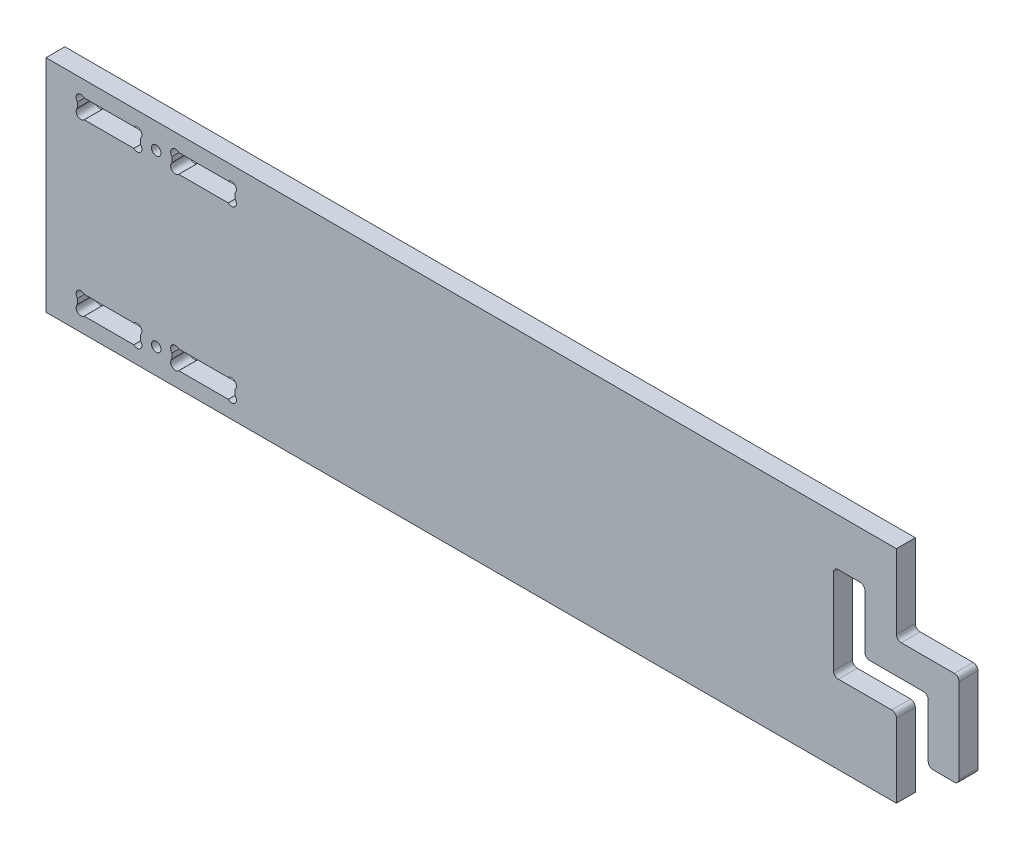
ISO-10303-21;
HEADER;
FILE_DESCRIPTION(('STEP AP214'),'2;1');
FILE_NAME('part.step','',(''),(''),'','','');
FILE_SCHEMA(('AUTOMOTIVE_DESIGN { 1 0 10303 214 1 1 1 1 }'));
ENDSEC;
DATA;
#1=APPLICATION_CONTEXT('core data for automotive mechanical design processes');
#2=APPLICATION_PROTOCOL_DEFINITION('international standard','automotive_design',2000,#1);
#3=PRODUCT_CONTEXT('',#1,'mechanical');
#4=PRODUCT('Part','Part','',(#3));
#5=PRODUCT_RELATED_PRODUCT_CATEGORY('part','',(#4));
#6=PRODUCT_DEFINITION_FORMATION('','',#4);
#7=PRODUCT_DEFINITION_CONTEXT('part definition',#1,'design');
#8=PRODUCT_DEFINITION('design','',#6,#7);
#9=PRODUCT_DEFINITION_SHAPE('','',#8);
#10=(LENGTH_UNIT() NAMED_UNIT(*) SI_UNIT(.MILLI.,.METRE.));
#11=(NAMED_UNIT(*) PLANE_ANGLE_UNIT() SI_UNIT($,.RADIAN.));
#12=(NAMED_UNIT(*) SI_UNIT($,.STERADIAN.) SOLID_ANGLE_UNIT());
#13=UNCERTAINTY_MEASURE_WITH_UNIT(LENGTH_MEASURE(1.E-05),#10,'distance_accuracy_value','');
#14=(GEOMETRIC_REPRESENTATION_CONTEXT(3) GLOBAL_UNCERTAINTY_ASSIGNED_CONTEXT((#13)) GLOBAL_UNIT_ASSIGNED_CONTEXT((#10,
#11,#12)) REPRESENTATION_CONTEXT('',''));
#15=CARTESIAN_POINT('',(0.,0.,0.));
#16=DIRECTION('',(0.,0.,1.));
#17=DIRECTION('',(1.,0.,0.));
#18=AXIS2_PLACEMENT_3D('',#15,#16,#17);
#19=CARTESIAN_POINT('',(268.49,23.39,6.));
#20=DIRECTION('',(0.,0.,-1.));
#21=DIRECTION('',(-1.,0.,0.));
#22=AXIS2_PLACEMENT_3D('',#19,#20,#21);
#23=PLANE('',#22);
#24=CARTESIAN_POINT('',(35.,8.00000000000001,6.));
#25=DIRECTION('',(0.,0.,1.));
#26=DIRECTION('',(1.,0.,0.));
#27=AXIS2_PLACEMENT_3D('',#24,#25,#26);
#28=CIRCLE('',#27,1.5);
#29=CARTESIAN_POINT('',(36.5,8.00000000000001,6.));
#30=VERTEX_POINT('',#29);
#31=EDGE_CURVE('E402',#30,#30,#28,.T.);
#32=ORIENTED_EDGE('',*,*,#31,.F.);
#33=EDGE_LOOP('',(#32));
#34=FACE_BOUND('',#33,.T.);
#35=CARTESIAN_POINT('',(58.9251976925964,60.0748023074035,6.));
#36=DIRECTION('',(0.,0.,1.));
#37=DIRECTION('',(-1.,0.,0.));
#38=AXIS2_PLACEMENT_3D('',#35,#36,#37);
#39=CIRCLE('',#38,1.52);
#40=CARTESIAN_POINT('',(57.8503953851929,59.,6.));
#41=VERTEX_POINT('',#40);
#42=CARTESIAN_POINT('',(60.,61.1496046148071,6.));
#43=VERTEX_POINT('',#42);
#44=EDGE_CURVE('E472',#41,#43,#39,.T.);
#45=ORIENTED_EDGE('',*,*,#44,.F.);
#46=DIRECTION('',(1.,0.,0.));
#47=VECTOR('',#46,1.);
#48=CARTESIAN_POINT('',(57.8503953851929,59.,6.));
#49=LINE('',#48,#47);
#50=CARTESIAN_POINT('',(42.1496046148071,59.,6.));
#51=VERTEX_POINT('',#50);
#52=EDGE_CURVE('E487',#51,#41,#49,.T.);
#53=ORIENTED_EDGE('',*,*,#52,.F.);
#54=CARTESIAN_POINT('',(41.0748023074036,60.0748023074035,6.));
#55=DIRECTION('',(0.,0.,1.));
#56=DIRECTION('',(1.,0.,0.));
#57=AXIS2_PLACEMENT_3D('',#54,#55,#56);
#58=CIRCLE('',#57,1.52);
#59=CARTESIAN_POINT('',(40.,61.1496046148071,6.));
#60=VERTEX_POINT('',#59);
#61=EDGE_CURVE('E484',#60,#51,#58,.T.);
#62=ORIENTED_EDGE('',*,*,#61,.F.);
#63=DIRECTION('',(0.,-1.,0.));
#64=VECTOR('',#63,1.);
#65=CARTESIAN_POINT('',(40.,61.1496046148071,6.));
#66=LINE('',#65,#64);
#67=CARTESIAN_POINT('',(40.,62.8503953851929,6.));
#68=VERTEX_POINT('',#67);
#69=EDGE_CURVE('E482',#68,#60,#66,.T.);
#70=ORIENTED_EDGE('',*,*,#69,.F.);
#71=CARTESIAN_POINT('',(41.0748023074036,63.9251976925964,6.));
#72=DIRECTION('',(0.,0.,1.));
#73=DIRECTION('',(-1.,0.,0.));
#74=AXIS2_PLACEMENT_3D('',#71,#72,#73);
#75=CIRCLE('',#74,1.52);
#76=CARTESIAN_POINT('',(42.1496046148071,65.,6.));
#77=VERTEX_POINT('',#76);
#78=EDGE_CURVE('E480',#77,#68,#75,.T.);
#79=ORIENTED_EDGE('',*,*,#78,.F.);
#80=DIRECTION('',(-1.,0.,0.));
#81=VECTOR('',#80,1.);
#82=CARTESIAN_POINT('',(57.8503953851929,65.,6.));
#83=LINE('',#82,#81);
#84=CARTESIAN_POINT('',(57.8503953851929,65.,6.));
#85=VERTEX_POINT('',#84);
#86=EDGE_CURVE('E478',#85,#77,#83,.T.);
#87=ORIENTED_EDGE('',*,*,#86,.F.);
#88=CARTESIAN_POINT('',(58.9251976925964,63.9251976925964,6.));
#89=DIRECTION('',(0.,0.,1.));
#90=DIRECTION('',(1.,0.,0.));
#91=AXIS2_PLACEMENT_3D('',#88,#89,#90);
#92=CIRCLE('',#91,1.51999999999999);
#93=CARTESIAN_POINT('',(60.,62.8503953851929,6.));
#94=VERTEX_POINT('',#93);
#95=EDGE_CURVE('E476',#94,#85,#92,.T.);
#96=ORIENTED_EDGE('',*,*,#95,.F.);
#97=DIRECTION('',(0.,1.,0.));
#98=VECTOR('',#97,1.);
#99=CARTESIAN_POINT('',(60.,61.1496046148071,6.));
#100=LINE('',#99,#98);
#101=EDGE_CURVE('E474',#43,#94,#100,.T.);
#102=ORIENTED_EDGE('',*,*,#101,.F.);
#103=EDGE_LOOP('',(#45,#53,#62,#70,#79,#87,#96,#102));
#104=FACE_BOUND('',#103,.T.);
#105=CARTESIAN_POINT('',(11.0748023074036,6.07480230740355,6.));
#106=DIRECTION('',(0.,0.,1.));
#107=DIRECTION('',(1.,0.,0.));
#108=AXIS2_PLACEMENT_3D('',#105,#106,#107);
#109=CIRCLE('',#108,1.52);
#110=CARTESIAN_POINT('',(10.,7.1496046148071,6.));
#111=VERTEX_POINT('',#110);
#112=CARTESIAN_POINT('',(12.1496046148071,5.,6.));
#113=VERTEX_POINT('',#112);
#114=EDGE_CURVE('E590',#111,#113,#109,.T.);
#115=ORIENTED_EDGE('',*,*,#114,.F.);
#116=DIRECTION('',(0.,-1.,0.));
#117=VECTOR('',#116,1.);
#118=CARTESIAN_POINT('',(10.,8.8503953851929,6.));
#119=LINE('',#118,#117);
#120=CARTESIAN_POINT('',(10.,8.8503953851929,6.));
#121=VERTEX_POINT('',#120);
#122=EDGE_CURVE('E605',#121,#111,#119,.T.);
#123=ORIENTED_EDGE('',*,*,#122,.F.);
#124=CARTESIAN_POINT('',(11.0748023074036,9.92519769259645,6.));
#125=DIRECTION('',(0.,0.,1.));
#126=DIRECTION('',(-1.,0.,0.));
#127=AXIS2_PLACEMENT_3D('',#124,#125,#126);
#128=CIRCLE('',#127,1.52);
#129=CARTESIAN_POINT('',(12.1496046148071,11.,6.));
#130=VERTEX_POINT('',#129);
#131=EDGE_CURVE('E602',#130,#121,#128,.T.);
#132=ORIENTED_EDGE('',*,*,#131,.F.);
#133=DIRECTION('',(-1.,0.,0.));
#134=VECTOR('',#133,1.);
#135=CARTESIAN_POINT('',(12.1496046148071,11.,6.));
#136=LINE('',#135,#134);
#137=CARTESIAN_POINT('',(27.8503953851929,11.,6.));
#138=VERTEX_POINT('',#137);
#139=EDGE_CURVE('E600',#138,#130,#136,.T.);
#140=ORIENTED_EDGE('',*,*,#139,.F.);
#141=CARTESIAN_POINT('',(28.9251976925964,9.92519769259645,6.));
#142=DIRECTION('',(0.,0.,1.));
#143=DIRECTION('',(1.,0.,0.));
#144=AXIS2_PLACEMENT_3D('',#141,#142,#143);
#145=CIRCLE('',#144,1.52);
#146=CARTESIAN_POINT('',(30.,8.85039538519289,6.));
#147=VERTEX_POINT('',#146);
#148=EDGE_CURVE('E598',#147,#138,#145,.T.);
#149=ORIENTED_EDGE('',*,*,#148,.F.);
#150=DIRECTION('',(0.,1.,0.));
#151=VECTOR('',#150,1.);
#152=CARTESIAN_POINT('',(30.,8.85039538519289,6.));
#153=LINE('',#152,#151);
#154=CARTESIAN_POINT('',(30.,7.14960461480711,6.));
#155=VERTEX_POINT('',#154);
#156=EDGE_CURVE('E596',#155,#147,#153,.T.);
#157=ORIENTED_EDGE('',*,*,#156,.F.);
#158=CARTESIAN_POINT('',(28.9251976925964,6.07480230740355,6.));
#159=DIRECTION('',(0.,0.,1.));
#160=DIRECTION('',(-1.,0.,0.));
#161=AXIS2_PLACEMENT_3D('',#158,#159,#160);
#162=CIRCLE('',#161,1.52);
#163=CARTESIAN_POINT('',(27.8503953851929,5.,6.));
#164=VERTEX_POINT('',#163);
#165=EDGE_CURVE('E594',#164,#155,#162,.T.);
#166=ORIENTED_EDGE('',*,*,#165,.F.);
#167=DIRECTION('',(1.,0.,0.));
#168=VECTOR('',#167,1.);
#169=CARTESIAN_POINT('',(12.1496046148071,5.,6.));
#170=LINE('',#169,#168);
#171=EDGE_CURVE('E592',#113,#164,#170,.T.);
#172=ORIENTED_EDGE('',*,*,#171,.F.);
#173=EDGE_LOOP('',(#115,#123,#132,#140,#149,#157,#166,#172));
#174=FACE_BOUND('',#173,.T.);
#175=DIRECTION('',(-1.,0.,0.));
#176=VECTOR('',#175,1.);
#177=CARTESIAN_POINT('',(270.,70.,6.));
#178=LINE('',#177,#176);
#179=CARTESIAN_POINT('',(270.,70.,6.));
#180=VERTEX_POINT('',#179);
#181=CARTESIAN_POINT('',(0.,69.9999999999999,6.));
#182=VERTEX_POINT('',#181);
#183=EDGE_CURVE('E674',#180,#182,#178,.T.);
#184=ORIENTED_EDGE('',*,*,#183,.T.);
#185=DIRECTION('',(0.,-1.,0.));
#186=VECTOR('',#185,1.);
#187=CARTESIAN_POINT('',(0.,69.9999999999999,6.));
#188=LINE('',#187,#186);
#189=CARTESIAN_POINT('',(0.,0.,6.));
#190=VERTEX_POINT('',#189);
#191=EDGE_CURVE('E677',#182,#190,#188,.T.);
#192=ORIENTED_EDGE('',*,*,#191,.T.);
#193=DIRECTION('',(1.,0.,0.));
#194=VECTOR('',#193,1.);
#195=CARTESIAN_POINT('',(0.,0.,6.));
#196=LINE('',#195,#194);
#197=CARTESIAN_POINT('',(270.,0.,6.));
#198=VERTEX_POINT('',#197);
#199=EDGE_CURVE('E679',#190,#198,#196,.T.);
#200=ORIENTED_EDGE('',*,*,#199,.T.);
#201=DIRECTION('',(0.,1.,0.));
#202=VECTOR('',#201,1.);
#203=CARTESIAN_POINT('',(270.,23.39,6.));
#204=LINE('',#203,#202);
#205=CARTESIAN_POINT('',(270.,23.39,6.));
#206=VERTEX_POINT('',#205);
#207=EDGE_CURVE('E681',#198,#206,#204,.T.);
#208=ORIENTED_EDGE('',*,*,#207,.T.);
#209=CARTESIAN_POINT('',(268.49,23.39,6.));
#210=DIRECTION('',(0.,0.,1.));
#211=DIRECTION('',(-1.,0.,0.));
#212=AXIS2_PLACEMENT_3D('',#209,#210,#211);
#213=CIRCLE('',#212,1.51000000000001);
#214=CARTESIAN_POINT('',(268.49,24.9,6.));
#215=VERTEX_POINT('',#214);
#216=EDGE_CURVE('E683',#206,#215,#213,.T.);
#217=ORIENTED_EDGE('',*,*,#216,.T.);
#218=DIRECTION('',(-1.,0.,0.));
#219=VECTOR('',#218,1.);
#220=CARTESIAN_POINT('',(251.53,24.9,6.));
#221=LINE('',#220,#219);
#222=CARTESIAN_POINT('',(251.53,24.9,6.));
#223=VERTEX_POINT('',#222);
#224=EDGE_CURVE('E685',#215,#223,#221,.T.);
#225=ORIENTED_EDGE('',*,*,#224,.T.);
#226=CARTESIAN_POINT('',(251.53,26.43,6.));
#227=DIRECTION('',(0.,0.,-1.));
#228=DIRECTION('',(1.,0.,0.));
#229=AXIS2_PLACEMENT_3D('',#226,#227,#228);
#230=CIRCLE('',#229,1.52999999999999);
#231=CARTESIAN_POINT('',(250.,26.43,6.));
#232=VERTEX_POINT('',#231);
#233=EDGE_CURVE('E687',#223,#232,#230,.T.);
#234=ORIENTED_EDGE('',*,*,#233,.T.);
#235=DIRECTION('',(0.,1.,0.));
#236=VECTOR('',#235,1.);
#237=CARTESIAN_POINT('',(250.,53.47,6.));
#238=LINE('',#237,#236);
#239=CARTESIAN_POINT('',(250.,53.47,6.));
#240=VERTEX_POINT('',#239);
#241=EDGE_CURVE('E689',#232,#240,#238,.T.);
#242=ORIENTED_EDGE('',*,*,#241,.T.);
#243=CARTESIAN_POINT('',(251.53,53.47,6.));
#244=DIRECTION('',(0.,0.,-1.));
#245=DIRECTION('',(1.,0.,0.));
#246=AXIS2_PLACEMENT_3D('',#243,#244,#245);
#247=CIRCLE('',#246,1.52999999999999);
#248=CARTESIAN_POINT('',(251.53,55.,6.));
#249=VERTEX_POINT('',#248);
#250=EDGE_CURVE('E691',#240,#249,#247,.T.);
#251=ORIENTED_EDGE('',*,*,#250,.T.);
#252=DIRECTION('',(1.,0.,0.));
#253=VECTOR('',#252,1.);
#254=CARTESIAN_POINT('',(258.47,55.,6.));
#255=LINE('',#254,#253);
#256=CARTESIAN_POINT('',(258.47,55.,6.));
#257=VERTEX_POINT('',#256);
#258=EDGE_CURVE('E693',#249,#257,#255,.T.);
#259=ORIENTED_EDGE('',*,*,#258,.T.);
#260=CARTESIAN_POINT('',(258.47,53.47,6.));
#261=DIRECTION('',(0.,0.,-1.));
#262=DIRECTION('',(1.,0.,0.));
#263=AXIS2_PLACEMENT_3D('',#260,#261,#262);
#264=CIRCLE('',#263,1.52999999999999);
#265=CARTESIAN_POINT('',(260.,53.47,6.));
#266=VERTEX_POINT('',#265);
#267=EDGE_CURVE('E695',#257,#266,#264,.T.);
#268=ORIENTED_EDGE('',*,*,#267,.T.);
#269=DIRECTION('',(0.,-1.,0.));
#270=VECTOR('',#269,1.);
#271=CARTESIAN_POINT('',(260.,36.51,6.));
#272=LINE('',#271,#270);
#273=CARTESIAN_POINT('',(260.,36.51,6.));
#274=VERTEX_POINT('',#273);
#275=EDGE_CURVE('E697',#266,#274,#272,.T.);
#276=ORIENTED_EDGE('',*,*,#275,.T.);
#277=CARTESIAN_POINT('',(261.51,36.51,6.));
#278=DIRECTION('',(0.,0.,1.));
#279=DIRECTION('',(-1.,0.,0.));
#280=AXIS2_PLACEMENT_3D('',#277,#278,#279);
#281=CIRCLE('',#280,1.51);
#282=CARTESIAN_POINT('',(261.51,35.,6.));
#283=VERTEX_POINT('',#282);
#284=EDGE_CURVE('E699',#274,#283,#281,.T.);
#285=ORIENTED_EDGE('',*,*,#284,.T.);
#286=DIRECTION('',(1.,0.,0.));
#287=VECTOR('',#286,1.);
#288=CARTESIAN_POINT('',(278.57,35.,6.));
#289=LINE('',#288,#287);
#290=CARTESIAN_POINT('',(278.57,35.,6.));
#291=VERTEX_POINT('',#290);
#292=EDGE_CURVE('E701',#283,#291,#289,.T.);
#293=ORIENTED_EDGE('',*,*,#292,.T.);
#294=CARTESIAN_POINT('',(278.57,33.47,6.));
#295=DIRECTION('',(0.,0.,-1.));
#296=DIRECTION('',(1.,0.,0.));
#297=AXIS2_PLACEMENT_3D('',#294,#295,#296);
#298=CIRCLE('',#297,1.52999999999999);
#299=CARTESIAN_POINT('',(280.1,33.47,6.));
#300=VERTEX_POINT('',#299);
#301=EDGE_CURVE('E703',#291,#300,#298,.T.);
#302=ORIENTED_EDGE('',*,*,#301,.T.);
#303=DIRECTION('',(0.,-1.,0.));
#304=VECTOR('',#303,1.);
#305=CARTESIAN_POINT('',(280.1,16.51,6.));
#306=LINE('',#305,#304);
#307=CARTESIAN_POINT('',(280.1,16.51,6.));
#308=VERTEX_POINT('',#307);
#309=EDGE_CURVE('E705',#300,#308,#306,.T.);
#310=ORIENTED_EDGE('',*,*,#309,.T.);
#311=CARTESIAN_POINT('',(281.61,16.51,6.));
#312=DIRECTION('',(0.,0.,1.));
#313=DIRECTION('',(-1.,0.,0.));
#314=AXIS2_PLACEMENT_3D('',#311,#312,#313);
#315=CIRCLE('',#314,1.51000000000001);
#316=CARTESIAN_POINT('',(281.61,15.,6.));
#317=VERTEX_POINT('',#316);
#318=EDGE_CURVE('E707',#308,#317,#315,.T.);
#319=ORIENTED_EDGE('',*,*,#318,.T.);
#320=DIRECTION('',(1.,0.,0.));
#321=VECTOR('',#320,1.);
#322=CARTESIAN_POINT('',(288.39,15.,6.));
#323=LINE('',#322,#321);
#324=CARTESIAN_POINT('',(288.39,15.,6.));
#325=VERTEX_POINT('',#324);
#326=EDGE_CURVE('E709',#317,#325,#323,.T.);
#327=ORIENTED_EDGE('',*,*,#326,.T.);
#328=CARTESIAN_POINT('',(288.39,16.51,6.));
#329=DIRECTION('',(0.,0.,1.));
#330=DIRECTION('',(-1.,0.,0.));
#331=AXIS2_PLACEMENT_3D('',#328,#329,#330);
#332=CIRCLE('',#331,1.51000000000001);
#333=CARTESIAN_POINT('',(289.9,16.51,6.));
#334=VERTEX_POINT('',#333);
#335=EDGE_CURVE('E711',#325,#334,#332,.T.);
#336=ORIENTED_EDGE('',*,*,#335,.T.);
#337=DIRECTION('',(0.,1.,0.));
#338=VECTOR('',#337,1.);
#339=CARTESIAN_POINT('',(289.9,43.39,6.));
#340=LINE('',#339,#338);
#341=CARTESIAN_POINT('',(289.9,43.39,6.));
#342=VERTEX_POINT('',#341);
#343=EDGE_CURVE('E713',#334,#342,#340,.T.);
#344=ORIENTED_EDGE('',*,*,#343,.T.);
#345=CARTESIAN_POINT('',(288.39,43.39,6.));
#346=DIRECTION('',(0.,0.,1.));
#347=DIRECTION('',(-1.,0.,0.));
#348=AXIS2_PLACEMENT_3D('',#345,#346,#347);
#349=CIRCLE('',#348,1.51);
#350=CARTESIAN_POINT('',(288.39,44.9,6.));
#351=VERTEX_POINT('',#350);
#352=EDGE_CURVE('E715',#342,#351,#349,.T.);
#353=ORIENTED_EDGE('',*,*,#352,.T.);
#354=DIRECTION('',(-1.,0.,0.));
#355=VECTOR('',#354,1.);
#356=CARTESIAN_POINT('',(271.53,44.9,6.));
#357=LINE('',#356,#355);
#358=CARTESIAN_POINT('',(271.53,44.9,6.));
#359=VERTEX_POINT('',#358);
#360=EDGE_CURVE('E717',#351,#359,#357,.T.);
#361=ORIENTED_EDGE('',*,*,#360,.T.);
#362=CARTESIAN_POINT('',(271.53,46.43,6.));
#363=DIRECTION('',(0.,0.,-1.));
#364=DIRECTION('',(1.,0.,0.));
#365=AXIS2_PLACEMENT_3D('',#362,#363,#364);
#366=CIRCLE('',#365,1.52999999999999);
#367=CARTESIAN_POINT('',(270.,46.43,6.));
#368=VERTEX_POINT('',#367);
#369=EDGE_CURVE('E719',#359,#368,#366,.T.);
#370=ORIENTED_EDGE('',*,*,#369,.T.);
#371=DIRECTION('',(0.,1.,0.));
#372=VECTOR('',#371,1.);
#373=CARTESIAN_POINT('',(270.,70.,6.));
#374=LINE('',#373,#372);
#375=EDGE_CURVE('E721',#368,#180,#374,.T.);
#376=ORIENTED_EDGE('',*,*,#375,.T.);
#377=EDGE_LOOP('',(#184,#192,#200,#208,#217,#225,#234,#242,#251,#259,#268,#276,#285,#293,#302,
#310,#319,#327,#336,#344,#353,#361,#370,#376));
#378=FACE_BOUND('',#377,.T.);
#379=CARTESIAN_POINT('',(58.9251976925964,9.92519769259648,6.));
#380=DIRECTION('',(0.,0.,1.));
#381=DIRECTION('',(1.,0.,0.));
#382=AXIS2_PLACEMENT_3D('',#379,#380,#381);
#383=CIRCLE('',#382,1.52);
#384=CARTESIAN_POINT('',(60.,8.85039538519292,6.));
#385=VERTEX_POINT('',#384);
#386=CARTESIAN_POINT('',(57.8503953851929,11.,6.));
#387=VERTEX_POINT('',#386);
#388=EDGE_CURVE('E531',#385,#387,#383,.T.);
#389=ORIENTED_EDGE('',*,*,#388,.F.);
#390=DIRECTION('',(0.,1.,0.));
#391=VECTOR('',#390,1.);
#392=CARTESIAN_POINT('',(60.,8.85039538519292,6.));
#393=LINE('',#392,#391);
#394=CARTESIAN_POINT('',(60.,7.14960461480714,6.));
#395=VERTEX_POINT('',#394);
#396=EDGE_CURVE('E546',#395,#385,#393,.T.);
#397=ORIENTED_EDGE('',*,*,#396,.F.);
#398=CARTESIAN_POINT('',(58.9251976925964,6.07480230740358,6.));
#399=DIRECTION('',(0.,0.,1.));
#400=DIRECTION('',(-1.,0.,0.));
#401=AXIS2_PLACEMENT_3D('',#398,#399,#400);
#402=CIRCLE('',#401,1.52);
#403=CARTESIAN_POINT('',(57.8503953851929,5.00000000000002,6.));
#404=VERTEX_POINT('',#403);
#405=EDGE_CURVE('E543',#404,#395,#402,.T.);
#406=ORIENTED_EDGE('',*,*,#405,.F.);
#407=DIRECTION('',(1.,0.,0.));
#408=VECTOR('',#407,1.);
#409=CARTESIAN_POINT('',(57.8503953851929,5.00000000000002,6.));
#410=LINE('',#409,#408);
#411=CARTESIAN_POINT('',(42.1496046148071,5.00000000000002,6.));
#412=VERTEX_POINT('',#411);
#413=EDGE_CURVE('E541',#412,#404,#410,.T.);
#414=ORIENTED_EDGE('',*,*,#413,.F.);
#415=CARTESIAN_POINT('',(41.0748023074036,6.07480230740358,6.));
#416=DIRECTION('',(0.,0.,1.));
#417=DIRECTION('',(1.,0.,0.));
#418=AXIS2_PLACEMENT_3D('',#415,#416,#417);
#419=CIRCLE('',#418,1.52);
#420=CARTESIAN_POINT('',(40.,7.14960461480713,6.));
#421=VERTEX_POINT('',#420);
#422=EDGE_CURVE('E539',#421,#412,#419,.T.);
#423=ORIENTED_EDGE('',*,*,#422,.F.);
#424=DIRECTION('',(0.,-1.,0.));
#425=VECTOR('',#424,1.);
#426=CARTESIAN_POINT('',(40.,8.85039538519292,6.));
#427=LINE('',#426,#425);
#428=CARTESIAN_POINT('',(40.,8.85039538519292,6.));
#429=VERTEX_POINT('',#428);
#430=EDGE_CURVE('E537',#429,#421,#427,.T.);
#431=ORIENTED_EDGE('',*,*,#430,.F.);
#432=CARTESIAN_POINT('',(41.0748023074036,9.92519769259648,6.));
#433=DIRECTION('',(0.,0.,1.));
#434=DIRECTION('',(-1.,0.,0.));
#435=AXIS2_PLACEMENT_3D('',#432,#433,#434);
#436=CIRCLE('',#435,1.52);
#437=CARTESIAN_POINT('',(42.1496046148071,11.,6.));
#438=VERTEX_POINT('',#437);
#439=EDGE_CURVE('E535',#438,#429,#436,.T.);
#440=ORIENTED_EDGE('',*,*,#439,.F.);
#441=DIRECTION('',(-1.,0.,0.));
#442=VECTOR('',#441,1.);
#443=CARTESIAN_POINT('',(57.8503953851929,11.,6.));
#444=LINE('',#443,#442);
#445=EDGE_CURVE('E533',#387,#438,#444,.T.);
#446=ORIENTED_EDGE('',*,*,#445,.F.);
#447=EDGE_LOOP('',(#389,#397,#406,#414,#423,#431,#440,#446));
#448=FACE_BOUND('',#447,.T.);
#449=CARTESIAN_POINT('',(28.9251976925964,63.9251976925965,6.));
#450=DIRECTION('',(0.,0.,1.));
#451=DIRECTION('',(1.,0.,0.));
#452=AXIS2_PLACEMENT_3D('',#449,#450,#451);
#453=CIRCLE('',#452,1.52);
#454=CARTESIAN_POINT('',(30.,62.8503953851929,6.));
#455=VERTEX_POINT('',#454);
#456=CARTESIAN_POINT('',(27.8503953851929,65.,6.));
#457=VERTEX_POINT('',#456);
#458=EDGE_CURVE('E394',#455,#457,#453,.T.);
#459=ORIENTED_EDGE('',*,*,#458,.F.);
#460=DIRECTION('',(0.,1.,0.));
#461=VECTOR('',#460,1.);
#462=CARTESIAN_POINT('',(30.,61.1496046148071,6.));
#463=LINE('',#462,#461);
#464=CARTESIAN_POINT('',(30.,61.1496046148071,6.));
#465=VERTEX_POINT('',#464);
#466=EDGE_CURVE('E435',#465,#455,#463,.T.);
#467=ORIENTED_EDGE('',*,*,#466,.F.);
#468=CARTESIAN_POINT('',(28.9251976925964,60.0748023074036,6.));
#469=DIRECTION('',(0.,0.,1.));
#470=DIRECTION('',(-1.,0.,0.));
#471=AXIS2_PLACEMENT_3D('',#468,#469,#470);
#472=CIRCLE('',#471,1.52);
#473=CARTESIAN_POINT('',(27.8503953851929,59.,6.));
#474=VERTEX_POINT('',#473);
#475=EDGE_CURVE('E433',#474,#465,#472,.T.);
#476=ORIENTED_EDGE('',*,*,#475,.F.);
#477=DIRECTION('',(1.,0.,0.));
#478=VECTOR('',#477,1.);
#479=CARTESIAN_POINT('',(12.1496046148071,59.,6.));
#480=LINE('',#479,#478);
#481=CARTESIAN_POINT('',(12.1496046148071,59.,6.));
#482=VERTEX_POINT('',#481);
#483=EDGE_CURVE('E431',#482,#474,#480,.T.);
#484=ORIENTED_EDGE('',*,*,#483,.F.);
#485=CARTESIAN_POINT('',(11.0748023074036,60.0748023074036,6.));
#486=DIRECTION('',(0.,0.,1.));
#487=DIRECTION('',(1.,0.,0.));
#488=AXIS2_PLACEMENT_3D('',#485,#486,#487);
#489=CIRCLE('',#488,1.52);
#490=CARTESIAN_POINT('',(10.,61.1496046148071,6.));
#491=VERTEX_POINT('',#490);
#492=EDGE_CURVE('E429',#491,#482,#489,.T.);
#493=ORIENTED_EDGE('',*,*,#492,.F.);
#494=DIRECTION('',(0.,-1.,0.));
#495=VECTOR('',#494,1.);
#496=CARTESIAN_POINT('',(10.,61.1496046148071,6.));
#497=LINE('',#496,#495);
#498=CARTESIAN_POINT('',(10.,62.8503953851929,6.));
#499=VERTEX_POINT('',#498);
#500=EDGE_CURVE('E427',#499,#491,#497,.T.);
#501=ORIENTED_EDGE('',*,*,#500,.F.);
#502=CARTESIAN_POINT('',(11.0748023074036,63.9251976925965,6.));
#503=DIRECTION('',(0.,0.,1.));
#504=DIRECTION('',(-1.,0.,0.));
#505=AXIS2_PLACEMENT_3D('',#502,#503,#504);
#506=CIRCLE('',#505,1.51999999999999);
#507=CARTESIAN_POINT('',(12.1496046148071,65.,6.));
#508=VERTEX_POINT('',#507);
#509=EDGE_CURVE('E425',#508,#499,#506,.T.);
#510=ORIENTED_EDGE('',*,*,#509,.F.);
#511=DIRECTION('',(-1.,0.,0.));
#512=VECTOR('',#511,1.);
#513=CARTESIAN_POINT('',(12.1496046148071,65.,6.));
#514=LINE('',#513,#512);
#515=EDGE_CURVE('E423',#457,#508,#514,.T.);
#516=ORIENTED_EDGE('',*,*,#515,.F.);
#517=EDGE_LOOP('',(#459,#467,#476,#484,#493,#501,#510,#516));
#518=FACE_BOUND('',#517,.T.);
#519=CARTESIAN_POINT('',(35.,62.,6.));
#520=DIRECTION('',(0.,0.,1.));
#521=DIRECTION('',(-1.,0.,0.));
#522=AXIS2_PLACEMENT_3D('',#519,#520,#521);
#523=CIRCLE('',#522,1.5);
#524=CARTESIAN_POINT('',(33.5,62.,6.));
#525=VERTEX_POINT('',#524);
#526=EDGE_CURVE('E1302',#525,#525,#523,.T.);
#527=ORIENTED_EDGE('',*,*,#526,.F.);
#528=EDGE_LOOP('',(#527));
#529=FACE_BOUND('',#528,.T.);
#530=ADVANCED_FACE('F26',(#34,#104,#174,#378,#448,#518,#529),#23,.F.);
#531=CARTESIAN_POINT('',(268.49,23.39,0.));
#532=DIRECTION('',(0.,0.,-1.));
#533=DIRECTION('',(-1.,0.,0.));
#534=AXIS2_PLACEMENT_3D('',#531,#532,#533);
#535=PLANE('',#534);
#536=CARTESIAN_POINT('',(35.,8.00000000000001,0.));
#537=DIRECTION('',(0.,0.,1.));
#538=DIRECTION('',(1.,0.,0.));
#539=AXIS2_PLACEMENT_3D('',#536,#537,#538);
#540=CIRCLE('',#539,1.5);
#541=CARTESIAN_POINT('',(36.5,8.00000000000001,0.));
#542=VERTEX_POINT('',#541);
#543=EDGE_CURVE('E405',#542,#542,#540,.T.);
#544=ORIENTED_EDGE('',*,*,#543,.T.);
#545=EDGE_LOOP('',(#544));
#546=FACE_BOUND('',#545,.T.);
#547=DIRECTION('',(1.,0.,0.));
#548=VECTOR('',#547,1.);
#549=CARTESIAN_POINT('',(57.8503953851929,59.,0.));
#550=LINE('',#549,#548);
#551=CARTESIAN_POINT('',(42.1496046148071,59.,0.));
#552=VERTEX_POINT('',#551);
#553=CARTESIAN_POINT('',(57.8503953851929,59.,0.));
#554=VERTEX_POINT('',#553);
#555=EDGE_CURVE('E469',#552,#554,#550,.T.);
#556=ORIENTED_EDGE('',*,*,#555,.T.);
#557=CARTESIAN_POINT('',(58.9251976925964,60.0748023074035,0.));
#558=DIRECTION('',(0.,0.,1.));
#559=DIRECTION('',(-1.,0.,0.));
#560=AXIS2_PLACEMENT_3D('',#557,#558,#559);
#561=CIRCLE('',#560,1.52);
#562=CARTESIAN_POINT('',(60.,61.1496046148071,0.));
#563=VERTEX_POINT('',#562);
#564=EDGE_CURVE('E395',#554,#563,#561,.T.);
#565=ORIENTED_EDGE('',*,*,#564,.T.);
#566=DIRECTION('',(0.,1.,0.));
#567=VECTOR('',#566,1.);
#568=CARTESIAN_POINT('',(60.,61.1496046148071,0.));
#569=LINE('',#568,#567);
#570=CARTESIAN_POINT('',(60.,62.8503953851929,0.));
#571=VERTEX_POINT('',#570);
#572=EDGE_CURVE('E451',#563,#571,#569,.T.);
#573=ORIENTED_EDGE('',*,*,#572,.T.);
#574=CARTESIAN_POINT('',(58.9251976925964,63.9251976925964,0.));
#575=DIRECTION('',(0.,0.,1.));
#576=DIRECTION('',(1.,0.,0.));
#577=AXIS2_PLACEMENT_3D('',#574,#575,#576);
#578=CIRCLE('',#577,1.51999999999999);
#579=CARTESIAN_POINT('',(57.8503953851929,65.,0.));
#580=VERTEX_POINT('',#579);
#581=EDGE_CURVE('E454',#571,#580,#578,.T.);
#582=ORIENTED_EDGE('',*,*,#581,.T.);
#583=DIRECTION('',(-1.,0.,0.));
#584=VECTOR('',#583,1.);
#585=CARTESIAN_POINT('',(57.8503953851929,65.,0.));
#586=LINE('',#585,#584);
#587=CARTESIAN_POINT('',(42.1496046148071,65.,0.));
#588=VERTEX_POINT('',#587);
#589=EDGE_CURVE('E457',#580,#588,#586,.T.);
#590=ORIENTED_EDGE('',*,*,#589,.T.);
#591=CARTESIAN_POINT('',(41.0748023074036,63.9251976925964,0.));
#592=DIRECTION('',(0.,0.,1.));
#593=DIRECTION('',(-1.,0.,0.));
#594=AXIS2_PLACEMENT_3D('',#591,#592,#593);
#595=CIRCLE('',#594,1.52);
#596=CARTESIAN_POINT('',(40.,62.8503953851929,0.));
#597=VERTEX_POINT('',#596);
#598=EDGE_CURVE('E460',#588,#597,#595,.T.);
#599=ORIENTED_EDGE('',*,*,#598,.T.);
#600=DIRECTION('',(0.,-1.,0.));
#601=VECTOR('',#600,1.);
#602=CARTESIAN_POINT('',(40.,61.1496046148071,0.));
#603=LINE('',#602,#601);
#604=CARTESIAN_POINT('',(40.,61.1496046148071,0.));
#605=VERTEX_POINT('',#604);
#606=EDGE_CURVE('E463',#597,#605,#603,.T.);
#607=ORIENTED_EDGE('',*,*,#606,.T.);
#608=CARTESIAN_POINT('',(41.0748023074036,60.0748023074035,0.));
#609=DIRECTION('',(0.,0.,1.));
#610=DIRECTION('',(1.,0.,0.));
#611=AXIS2_PLACEMENT_3D('',#608,#609,#610);
#612=CIRCLE('',#611,1.52);
#613=EDGE_CURVE('E466',#605,#552,#612,.T.);
#614=ORIENTED_EDGE('',*,*,#613,.T.);
#615=EDGE_LOOP('',(#556,#565,#573,#582,#590,#599,#607,#614));
#616=FACE_BOUND('',#615,.T.);
#617=DIRECTION('',(0.,-1.,0.));
#618=VECTOR('',#617,1.);
#619=CARTESIAN_POINT('',(10.,8.8503953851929,0.));
#620=LINE('',#619,#618);
#621=CARTESIAN_POINT('',(10.,8.8503953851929,0.));
#622=VERTEX_POINT('',#621);
#623=CARTESIAN_POINT('',(10.,7.14960461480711,0.));
#624=VERTEX_POINT('',#623);
#625=EDGE_CURVE('E587',#622,#624,#620,.T.);
#626=ORIENTED_EDGE('',*,*,#625,.T.);
#627=CARTESIAN_POINT('',(11.0748023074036,6.07480230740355,0.));
#628=DIRECTION('',(0.,0.,1.));
#629=DIRECTION('',(1.,0.,0.));
#630=AXIS2_PLACEMENT_3D('',#627,#628,#629);
#631=CIRCLE('',#630,1.52);
#632=CARTESIAN_POINT('',(12.1496046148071,5.,0.));
#633=VERTEX_POINT('',#632);
#634=EDGE_CURVE('E566',#624,#633,#631,.T.);
#635=ORIENTED_EDGE('',*,*,#634,.T.);
#636=DIRECTION('',(1.,0.,0.));
#637=VECTOR('',#636,1.);
#638=CARTESIAN_POINT('',(12.1496046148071,5.,0.));
#639=LINE('',#638,#637);
#640=CARTESIAN_POINT('',(27.8503953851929,5.,0.));
#641=VERTEX_POINT('',#640);
#642=EDGE_CURVE('E569',#633,#641,#639,.T.);
#643=ORIENTED_EDGE('',*,*,#642,.T.);
#644=CARTESIAN_POINT('',(28.9251976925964,6.07480230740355,0.));
#645=DIRECTION('',(0.,0.,1.));
#646=DIRECTION('',(-1.,0.,0.));
#647=AXIS2_PLACEMENT_3D('',#644,#645,#646);
#648=CIRCLE('',#647,1.52);
#649=CARTESIAN_POINT('',(30.,7.14960461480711,0.));
#650=VERTEX_POINT('',#649);
#651=EDGE_CURVE('E572',#641,#650,#648,.T.);
#652=ORIENTED_EDGE('',*,*,#651,.T.);
#653=DIRECTION('',(0.,1.,0.));
#654=VECTOR('',#653,1.);
#655=CARTESIAN_POINT('',(30.,8.85039538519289,0.));
#656=LINE('',#655,#654);
#657=CARTESIAN_POINT('',(30.,8.85039538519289,0.));
#658=VERTEX_POINT('',#657);
#659=EDGE_CURVE('E575',#650,#658,#656,.T.);
#660=ORIENTED_EDGE('',*,*,#659,.T.);
#661=CARTESIAN_POINT('',(28.9251976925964,9.92519769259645,0.));
#662=DIRECTION('',(0.,0.,1.));
#663=DIRECTION('',(1.,0.,0.));
#664=AXIS2_PLACEMENT_3D('',#661,#662,#663);
#665=CIRCLE('',#664,1.52);
#666=CARTESIAN_POINT('',(27.8503953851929,11.,0.));
#667=VERTEX_POINT('',#666);
#668=EDGE_CURVE('E578',#658,#667,#665,.T.);
#669=ORIENTED_EDGE('',*,*,#668,.T.);
#670=DIRECTION('',(-1.,0.,0.));
#671=VECTOR('',#670,1.);
#672=CARTESIAN_POINT('',(12.1496046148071,11.,0.));
#673=LINE('',#672,#671);
#674=CARTESIAN_POINT('',(12.1496046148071,11.,0.));
#675=VERTEX_POINT('',#674);
#676=EDGE_CURVE('E581',#667,#675,#673,.T.);
#677=ORIENTED_EDGE('',*,*,#676,.T.);
#678=CARTESIAN_POINT('',(11.0748023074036,9.92519769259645,0.));
#679=DIRECTION('',(0.,0.,1.));
#680=DIRECTION('',(-1.,0.,0.));
#681=AXIS2_PLACEMENT_3D('',#678,#679,#680);
#682=CIRCLE('',#681,1.52);
#683=EDGE_CURVE('E584',#675,#622,#682,.T.);
#684=ORIENTED_EDGE('',*,*,#683,.T.);
#685=EDGE_LOOP('',(#626,#635,#643,#652,#660,#669,#677,#684));
#686=FACE_BOUND('',#685,.T.);
#687=DIRECTION('',(-1.,0.,0.));
#688=VECTOR('',#687,1.);
#689=CARTESIAN_POINT('',(270.,70.,0.));
#690=LINE('',#689,#688);
#691=CARTESIAN_POINT('',(270.,70.,0.));
#692=VERTEX_POINT('',#691);
#693=CARTESIAN_POINT('',(0.,69.9999999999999,0.));
#694=VERTEX_POINT('',#693);
#695=EDGE_CURVE('E625',#692,#694,#690,.T.);
#696=ORIENTED_EDGE('',*,*,#695,.F.);
#697=DIRECTION('',(0.,1.,0.));
#698=VECTOR('',#697,1.);
#699=CARTESIAN_POINT('',(270.,70.,0.));
#700=LINE('',#699,#698);
#701=CARTESIAN_POINT('',(270.,46.43,0.));
#702=VERTEX_POINT('',#701);
#703=EDGE_CURVE('E672',#702,#692,#700,.T.);
#704=ORIENTED_EDGE('',*,*,#703,.F.);
#705=CARTESIAN_POINT('',(271.53,46.43,0.));
#706=DIRECTION('',(0.,0.,-1.));
#707=DIRECTION('',(1.,0.,0.));
#708=AXIS2_PLACEMENT_3D('',#705,#706,#707);
#709=CIRCLE('',#708,1.52999999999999);
#710=CARTESIAN_POINT('',(271.53,44.9,0.));
#711=VERTEX_POINT('',#710);
#712=EDGE_CURVE('E670',#711,#702,#709,.T.);
#713=ORIENTED_EDGE('',*,*,#712,.F.);
#714=DIRECTION('',(-1.,0.,0.));
#715=VECTOR('',#714,1.);
#716=CARTESIAN_POINT('',(271.53,44.9,0.));
#717=LINE('',#716,#715);
#718=CARTESIAN_POINT('',(288.39,44.9,0.));
#719=VERTEX_POINT('',#718);
#720=EDGE_CURVE('E668',#719,#711,#717,.T.);
#721=ORIENTED_EDGE('',*,*,#720,.F.);
#722=CARTESIAN_POINT('',(288.39,43.39,0.));
#723=DIRECTION('',(0.,0.,1.));
#724=DIRECTION('',(-1.,0.,0.));
#725=AXIS2_PLACEMENT_3D('',#722,#723,#724);
#726=CIRCLE('',#725,1.51);
#727=CARTESIAN_POINT('',(289.9,43.39,0.));
#728=VERTEX_POINT('',#727);
#729=EDGE_CURVE('E666',#728,#719,#726,.T.);
#730=ORIENTED_EDGE('',*,*,#729,.F.);
#731=DIRECTION('',(0.,1.,0.));
#732=VECTOR('',#731,1.);
#733=CARTESIAN_POINT('',(289.9,43.39,0.));
#734=LINE('',#733,#732);
#735=CARTESIAN_POINT('',(289.9,16.51,0.));
#736=VERTEX_POINT('',#735);
#737=EDGE_CURVE('E664',#736,#728,#734,.T.);
#738=ORIENTED_EDGE('',*,*,#737,.F.);
#739=CARTESIAN_POINT('',(288.39,16.51,0.));
#740=DIRECTION('',(0.,0.,1.));
#741=DIRECTION('',(-1.,0.,0.));
#742=AXIS2_PLACEMENT_3D('',#739,#740,#741);
#743=CIRCLE('',#742,1.51000000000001);
#744=CARTESIAN_POINT('',(288.39,15.,0.));
#745=VERTEX_POINT('',#744);
#746=EDGE_CURVE('E662',#745,#736,#743,.T.);
#747=ORIENTED_EDGE('',*,*,#746,.F.);
#748=DIRECTION('',(1.,0.,0.));
#749=VECTOR('',#748,1.);
#750=CARTESIAN_POINT('',(288.39,15.,0.));
#751=LINE('',#750,#749);
#752=CARTESIAN_POINT('',(281.61,15.,0.));
#753=VERTEX_POINT('',#752);
#754=EDGE_CURVE('E660',#753,#745,#751,.T.);
#755=ORIENTED_EDGE('',*,*,#754,.F.);
#756=CARTESIAN_POINT('',(281.61,16.51,0.));
#757=DIRECTION('',(0.,0.,1.));
#758=DIRECTION('',(-1.,0.,0.));
#759=AXIS2_PLACEMENT_3D('',#756,#757,#758);
#760=CIRCLE('',#759,1.51000000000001);
#761=CARTESIAN_POINT('',(280.1,16.51,0.));
#762=VERTEX_POINT('',#761);
#763=EDGE_CURVE('E658',#762,#753,#760,.T.);
#764=ORIENTED_EDGE('',*,*,#763,.F.);
#765=DIRECTION('',(0.,-1.,0.));
#766=VECTOR('',#765,1.);
#767=CARTESIAN_POINT('',(280.1,16.51,0.));
#768=LINE('',#767,#766);
#769=CARTESIAN_POINT('',(280.1,33.47,0.));
#770=VERTEX_POINT('',#769);
#771=EDGE_CURVE('E656',#770,#762,#768,.T.);
#772=ORIENTED_EDGE('',*,*,#771,.F.);
#773=CARTESIAN_POINT('',(278.57,33.47,0.));
#774=DIRECTION('',(0.,0.,-1.));
#775=DIRECTION('',(1.,0.,0.));
#776=AXIS2_PLACEMENT_3D('',#773,#774,#775);
#777=CIRCLE('',#776,1.52999999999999);
#778=CARTESIAN_POINT('',(278.57,35.,0.));
#779=VERTEX_POINT('',#778);
#780=EDGE_CURVE('E654',#779,#770,#777,.T.);
#781=ORIENTED_EDGE('',*,*,#780,.F.);
#782=DIRECTION('',(1.,0.,0.));
#783=VECTOR('',#782,1.);
#784=CARTESIAN_POINT('',(278.57,35.,0.));
#785=LINE('',#784,#783);
#786=CARTESIAN_POINT('',(261.51,35.,0.));
#787=VERTEX_POINT('',#786);
#788=EDGE_CURVE('E652',#787,#779,#785,.T.);
#789=ORIENTED_EDGE('',*,*,#788,.F.);
#790=CARTESIAN_POINT('',(261.51,36.51,0.));
#791=DIRECTION('',(0.,0.,1.));
#792=DIRECTION('',(-1.,0.,0.));
#793=AXIS2_PLACEMENT_3D('',#790,#791,#792);
#794=CIRCLE('',#793,1.51);
#795=CARTESIAN_POINT('',(260.,36.51,0.));
#796=VERTEX_POINT('',#795);
#797=EDGE_CURVE('E650',#796,#787,#794,.T.);
#798=ORIENTED_EDGE('',*,*,#797,.F.);
#799=DIRECTION('',(0.,-1.,0.));
#800=VECTOR('',#799,1.);
#801=CARTESIAN_POINT('',(260.,36.51,0.));
#802=LINE('',#801,#800);
#803=CARTESIAN_POINT('',(260.,53.47,0.));
#804=VERTEX_POINT('',#803);
#805=EDGE_CURVE('E648',#804,#796,#802,.T.);
#806=ORIENTED_EDGE('',*,*,#805,.F.);
#807=CARTESIAN_POINT('',(258.47,53.47,0.));
#808=DIRECTION('',(0.,0.,-1.));
#809=DIRECTION('',(1.,0.,0.));
#810=AXIS2_PLACEMENT_3D('',#807,#808,#809);
#811=CIRCLE('',#810,1.52999999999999);
#812=CARTESIAN_POINT('',(258.47,55.,0.));
#813=VERTEX_POINT('',#812);
#814=EDGE_CURVE('E646',#813,#804,#811,.T.);
#815=ORIENTED_EDGE('',*,*,#814,.F.);
#816=DIRECTION('',(1.,0.,0.));
#817=VECTOR('',#816,1.);
#818=CARTESIAN_POINT('',(258.47,55.,0.));
#819=LINE('',#818,#817);
#820=CARTESIAN_POINT('',(251.53,55.,0.));
#821=VERTEX_POINT('',#820);
#822=EDGE_CURVE('E644',#821,#813,#819,.T.);
#823=ORIENTED_EDGE('',*,*,#822,.F.);
#824=CARTESIAN_POINT('',(251.53,53.47,0.));
#825=DIRECTION('',(0.,0.,-1.));
#826=DIRECTION('',(1.,0.,0.));
#827=AXIS2_PLACEMENT_3D('',#824,#825,#826);
#828=CIRCLE('',#827,1.52999999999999);
#829=CARTESIAN_POINT('',(250.,53.47,0.));
#830=VERTEX_POINT('',#829);
#831=EDGE_CURVE('E642',#830,#821,#828,.T.);
#832=ORIENTED_EDGE('',*,*,#831,.F.);
#833=DIRECTION('',(0.,1.,0.));
#834=VECTOR('',#833,1.);
#835=CARTESIAN_POINT('',(250.,53.47,0.));
#836=LINE('',#835,#834);
#837=CARTESIAN_POINT('',(250.,26.43,0.));
#838=VERTEX_POINT('',#837);
#839=EDGE_CURVE('E640',#838,#830,#836,.T.);
#840=ORIENTED_EDGE('',*,*,#839,.F.);
#841=CARTESIAN_POINT('',(251.53,26.43,0.));
#842=DIRECTION('',(0.,0.,-1.));
#843=DIRECTION('',(1.,0.,0.));
#844=AXIS2_PLACEMENT_3D('',#841,#842,#843);
#845=CIRCLE('',#844,1.52999999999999);
#846=CARTESIAN_POINT('',(251.53,24.9,0.));
#847=VERTEX_POINT('',#846);
#848=EDGE_CURVE('E638',#847,#838,#845,.T.);
#849=ORIENTED_EDGE('',*,*,#848,.F.);
#850=DIRECTION('',(-1.,0.,0.));
#851=VECTOR('',#850,1.);
#852=CARTESIAN_POINT('',(251.53,24.9,0.));
#853=LINE('',#852,#851);
#854=CARTESIAN_POINT('',(268.49,24.9,0.));
#855=VERTEX_POINT('',#854);
#856=EDGE_CURVE('E636',#855,#847,#853,.T.);
#857=ORIENTED_EDGE('',*,*,#856,.F.);
#858=CARTESIAN_POINT('',(268.49,23.39,0.));
#859=DIRECTION('',(0.,0.,1.));
#860=DIRECTION('',(-1.,0.,0.));
#861=AXIS2_PLACEMENT_3D('',#858,#859,#860);
#862=CIRCLE('',#861,1.51000000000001);
#863=CARTESIAN_POINT('',(270.,23.39,0.));
#864=VERTEX_POINT('',#863);
#865=EDGE_CURVE('E634',#864,#855,#862,.T.);
#866=ORIENTED_EDGE('',*,*,#865,.F.);
#867=DIRECTION('',(0.,1.,0.));
#868=VECTOR('',#867,1.);
#869=CARTESIAN_POINT('',(270.,23.39,0.));
#870=LINE('',#869,#868);
#871=CARTESIAN_POINT('',(270.,0.,0.));
#872=VERTEX_POINT('',#871);
#873=EDGE_CURVE('E632',#872,#864,#870,.T.);
#874=ORIENTED_EDGE('',*,*,#873,.F.);
#875=DIRECTION('',(1.,0.,0.));
#876=VECTOR('',#875,1.);
#877=CARTESIAN_POINT('',(0.,0.,0.));
#878=LINE('',#877,#876);
#879=CARTESIAN_POINT('',(0.,0.,0.));
#880=VERTEX_POINT('',#879);
#881=EDGE_CURVE('E630',#880,#872,#878,.T.);
#882=ORIENTED_EDGE('',*,*,#881,.F.);
#883=DIRECTION('',(0.,-1.,0.));
#884=VECTOR('',#883,1.);
#885=CARTESIAN_POINT('',(0.,69.9999999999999,0.));
#886=LINE('',#885,#884);
#887=EDGE_CURVE('E628',#694,#880,#886,.T.);
#888=ORIENTED_EDGE('',*,*,#887,.F.);
#889=EDGE_LOOP('',(#696,#704,#713,#721,#730,#738,#747,#755,#764,#772,#781,#789,#798,#806,#815,
#823,#832,#840,#849,#857,#866,#874,#882,#888));
#890=FACE_BOUND('',#889,.T.);
#891=DIRECTION('',(0.,1.,0.));
#892=VECTOR('',#891,1.);
#893=CARTESIAN_POINT('',(60.,8.85039538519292,0.));
#894=LINE('',#893,#892);
#895=CARTESIAN_POINT('',(60.,7.14960461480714,0.));
#896=VERTEX_POINT('',#895);
#897=CARTESIAN_POINT('',(60.,8.85039538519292,0.));
#898=VERTEX_POINT('',#897);
#899=EDGE_CURVE('E528',#896,#898,#894,.T.);
#900=ORIENTED_EDGE('',*,*,#899,.T.);
#901=CARTESIAN_POINT('',(58.9251976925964,9.92519769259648,0.));
#902=DIRECTION('',(0.,0.,1.));
#903=DIRECTION('',(1.,0.,0.));
#904=AXIS2_PLACEMENT_3D('',#901,#902,#903);
#905=CIRCLE('',#904,1.52);
#906=CARTESIAN_POINT('',(57.8503953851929,11.,0.));
#907=VERTEX_POINT('',#906);
#908=EDGE_CURVE('E507',#898,#907,#905,.T.);
#909=ORIENTED_EDGE('',*,*,#908,.T.);
#910=DIRECTION('',(-1.,0.,0.));
#911=VECTOR('',#910,1.);
#912=CARTESIAN_POINT('',(57.8503953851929,11.,0.));
#913=LINE('',#912,#911);
#914=CARTESIAN_POINT('',(42.1496046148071,11.,0.));
#915=VERTEX_POINT('',#914);
#916=EDGE_CURVE('E510',#907,#915,#913,.T.);
#917=ORIENTED_EDGE('',*,*,#916,.T.);
#918=CARTESIAN_POINT('',(41.0748023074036,9.92519769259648,0.));
#919=DIRECTION('',(0.,0.,1.));
#920=DIRECTION('',(-1.,0.,0.));
#921=AXIS2_PLACEMENT_3D('',#918,#919,#920);
#922=CIRCLE('',#921,1.52);
#923=CARTESIAN_POINT('',(40.,8.85039538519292,0.));
#924=VERTEX_POINT('',#923);
#925=EDGE_CURVE('E513',#915,#924,#922,.T.);
#926=ORIENTED_EDGE('',*,*,#925,.T.);
#927=DIRECTION('',(0.,-1.,0.));
#928=VECTOR('',#927,1.);
#929=CARTESIAN_POINT('',(40.,8.85039538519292,0.));
#930=LINE('',#929,#928);
#931=CARTESIAN_POINT('',(40.,7.14960461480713,0.));
#932=VERTEX_POINT('',#931);
#933=EDGE_CURVE('E516',#924,#932,#930,.T.);
#934=ORIENTED_EDGE('',*,*,#933,.T.);
#935=CARTESIAN_POINT('',(41.0748023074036,6.07480230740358,0.));
#936=DIRECTION('',(0.,0.,1.));
#937=DIRECTION('',(1.,0.,0.));
#938=AXIS2_PLACEMENT_3D('',#935,#936,#937);
#939=CIRCLE('',#938,1.52);
#940=CARTESIAN_POINT('',(42.1496046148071,5.00000000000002,0.));
#941=VERTEX_POINT('',#940);
#942=EDGE_CURVE('E519',#932,#941,#939,.T.);
#943=ORIENTED_EDGE('',*,*,#942,.T.);
#944=DIRECTION('',(1.,0.,0.));
#945=VECTOR('',#944,1.);
#946=CARTESIAN_POINT('',(57.8503953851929,5.00000000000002,0.));
#947=LINE('',#946,#945);
#948=CARTESIAN_POINT('',(57.8503953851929,5.00000000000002,0.));
#949=VERTEX_POINT('',#948);
#950=EDGE_CURVE('E522',#941,#949,#947,.T.);
#951=ORIENTED_EDGE('',*,*,#950,.T.);
#952=CARTESIAN_POINT('',(58.9251976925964,6.07480230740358,0.));
#953=DIRECTION('',(0.,0.,1.));
#954=DIRECTION('',(-1.,0.,0.));
#955=AXIS2_PLACEMENT_3D('',#952,#953,#954);
#956=CIRCLE('',#955,1.52);
#957=EDGE_CURVE('E525',#949,#896,#956,.T.);
#958=ORIENTED_EDGE('',*,*,#957,.T.);
#959=EDGE_LOOP('',(#900,#909,#917,#926,#934,#943,#951,#958));
#960=FACE_BOUND('',#959,.T.);
#961=DIRECTION('',(0.,1.,0.));
#962=VECTOR('',#961,1.);
#963=CARTESIAN_POINT('',(30.,61.1496046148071,0.));
#964=LINE('',#963,#962);
#965=CARTESIAN_POINT('',(30.,61.1496046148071,0.));
#966=VERTEX_POINT('',#965);
#967=CARTESIAN_POINT('',(30.,62.8503953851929,0.));
#968=VERTEX_POINT('',#967);
#969=EDGE_CURVE('E401',#966,#968,#964,.T.);
#970=ORIENTED_EDGE('',*,*,#969,.T.);
#971=CARTESIAN_POINT('',(28.9251976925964,63.9251976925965,0.));
#972=DIRECTION('',(0.,0.,1.));
#973=DIRECTION('',(1.,0.,0.));
#974=AXIS2_PLACEMENT_3D('',#971,#972,#973);
#975=CIRCLE('',#974,1.52);
#976=CARTESIAN_POINT('',(27.8503953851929,65.,0.));
#977=VERTEX_POINT('',#976);
#978=EDGE_CURVE('E49',#968,#977,#975,.T.);
#979=ORIENTED_EDGE('',*,*,#978,.T.);
#980=DIRECTION('',(-1.,0.,0.));
#981=VECTOR('',#980,1.);
#982=CARTESIAN_POINT('',(12.1496046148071,65.,0.));
#983=LINE('',#982,#981);
#984=CARTESIAN_POINT('',(12.1496046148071,65.,0.));
#985=VERTEX_POINT('',#984);
#986=EDGE_CURVE('E381',#977,#985,#983,.T.);
#987=ORIENTED_EDGE('',*,*,#986,.T.);
#988=CARTESIAN_POINT('',(11.0748023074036,63.9251976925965,0.));
#989=DIRECTION('',(0.,0.,1.));
#990=DIRECTION('',(-1.,0.,0.));
#991=AXIS2_PLACEMENT_3D('',#988,#989,#990);
#992=CIRCLE('',#991,1.51999999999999);
#993=CARTESIAN_POINT('',(10.,62.8503953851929,0.));
#994=VERTEX_POINT('',#993);
#995=EDGE_CURVE('E390',#985,#994,#992,.T.);
#996=ORIENTED_EDGE('',*,*,#995,.T.);
#997=DIRECTION('',(0.,-1.,0.));
#998=VECTOR('',#997,1.);
#999=CARTESIAN_POINT('',(10.,61.1496046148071,0.));
#1000=LINE('',#999,#998);
#1001=CARTESIAN_POINT('',(10.,61.1496046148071,0.));
#1002=VERTEX_POINT('',#1001);
#1003=EDGE_CURVE('E410',#994,#1002,#1000,.T.);
#1004=ORIENTED_EDGE('',*,*,#1003,.T.);
#1005=CARTESIAN_POINT('',(11.0748023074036,60.0748023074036,0.));
#1006=DIRECTION('',(0.,0.,1.));
#1007=DIRECTION('',(1.,0.,0.));
#1008=AXIS2_PLACEMENT_3D('',#1005,#1006,#1007);
#1009=CIRCLE('',#1008,1.52);
#1010=CARTESIAN_POINT('',(12.1496046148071,59.,0.));
#1011=VERTEX_POINT('',#1010);
#1012=EDGE_CURVE('E413',#1002,#1011,#1009,.T.);
#1013=ORIENTED_EDGE('',*,*,#1012,.T.);
#1014=DIRECTION('',(1.,0.,0.));
#1015=VECTOR('',#1014,1.);
#1016=CARTESIAN_POINT('',(12.1496046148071,59.,0.));
#1017=LINE('',#1016,#1015);
#1018=CARTESIAN_POINT('',(27.8503953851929,59.,0.));
#1019=VERTEX_POINT('',#1018);
#1020=EDGE_CURVE('E416',#1011,#1019,#1017,.T.);
#1021=ORIENTED_EDGE('',*,*,#1020,.T.);
#1022=CARTESIAN_POINT('',(28.9251976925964,60.0748023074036,0.));
#1023=DIRECTION('',(0.,0.,1.));
#1024=DIRECTION('',(-1.,0.,0.));
#1025=AXIS2_PLACEMENT_3D('',#1022,#1023,#1024);
#1026=CIRCLE('',#1025,1.52);
#1027=EDGE_CURVE('E419',#1019,#966,#1026,.T.);
#1028=ORIENTED_EDGE('',*,*,#1027,.T.);
#1029=EDGE_LOOP('',(#970,#979,#987,#996,#1004,#1013,#1021,#1028));
#1030=FACE_BOUND('',#1029,.T.);
#1031=CARTESIAN_POINT('',(35.,62.,0.));
#1032=DIRECTION('',(0.,0.,1.));
#1033=DIRECTION('',(-1.,0.,0.));
#1034=AXIS2_PLACEMENT_3D('',#1031,#1032,#1033);
#1035=CIRCLE('',#1034,1.5);
#1036=CARTESIAN_POINT('',(33.5,62.,0.));
#1037=VERTEX_POINT('',#1036);
#1038=EDGE_CURVE('E1305',#1037,#1037,#1035,.T.);
#1039=ORIENTED_EDGE('',*,*,#1038,.T.);
#1040=EDGE_LOOP('',(#1039));
#1041=FACE_BOUND('',#1040,.T.);
#1042=ADVANCED_FACE('F398',(#546,#616,#686,#890,#960,#1030,#1041),#535,.T.);
#1043=CARTESIAN_POINT('',(270.,70.,6.));
#1044=DIRECTION('',(0.,-1.,0.));
#1045=DIRECTION('',(1.,0.,0.));
#1046=AXIS2_PLACEMENT_3D('',#1043,#1044,#1045);
#1047=PLANE('',#1046);
#1048=ORIENTED_EDGE('',*,*,#695,.T.);
#1049=DIRECTION('',(0.,0.,-1.));
#1050=VECTOR('',#1049,1.);
#1051=CARTESIAN_POINT('',(0.,69.9999999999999,6.));
#1052=LINE('',#1051,#1050);
#1053=EDGE_CURVE('E11',#182,#694,#1052,.T.);
#1054=ORIENTED_EDGE('',*,*,#1053,.F.);
#1055=ORIENTED_EDGE('',*,*,#183,.F.);
#1056=DIRECTION('',(0.,0.,-1.));
#1057=VECTOR('',#1056,1.);
#1058=CARTESIAN_POINT('',(270.,70.,6.));
#1059=LINE('',#1058,#1057);
#1060=EDGE_CURVE('E723',#180,#692,#1059,.T.);
#1061=ORIENTED_EDGE('',*,*,#1060,.T.);
#1062=EDGE_LOOP('',(#1048,#1054,#1055,#1061));
#1063=FACE_BOUND('',#1062,.T.);
#1064=ADVANCED_FACE('F28',(#1063),#1047,.F.);
#1065=CARTESIAN_POINT('',(0.,69.9999999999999,6.));
#1066=DIRECTION('',(1.,0.,0.));
#1067=DIRECTION('',(0.,0.,-1.));
#1068=AXIS2_PLACEMENT_3D('',#1065,#1066,#1067);
#1069=PLANE('',#1068);
#1070=ORIENTED_EDGE('',*,*,#887,.T.);
#1071=DIRECTION('',(0.,0.,-1.));
#1072=VECTOR('',#1071,1.);
#1073=CARTESIAN_POINT('',(0.,0.,6.));
#1074=LINE('',#1073,#1072);
#1075=EDGE_CURVE('E34',#190,#880,#1074,.T.);
#1076=ORIENTED_EDGE('',*,*,#1075,.F.);
#1077=ORIENTED_EDGE('',*,*,#191,.F.);
#1078=ORIENTED_EDGE('',*,*,#1053,.T.);
#1079=EDGE_LOOP('',(#1070,#1076,#1077,#1078));
#1080=FACE_BOUND('',#1079,.T.);
#1081=ADVANCED_FACE('F816',(#1080),#1069,.F.);
#1082=CARTESIAN_POINT('',(0.,0.,6.));
#1083=DIRECTION('',(0.,1.,0.));
#1084=DIRECTION('',(0.,0.,1.));
#1085=AXIS2_PLACEMENT_3D('',#1082,#1083,#1084);
#1086=PLANE('',#1085);
#1087=ORIENTED_EDGE('',*,*,#881,.T.);
#1088=DIRECTION('',(0.,0.,-1.));
#1089=VECTOR('',#1088,1.);
#1090=CARTESIAN_POINT('',(270.,0.,6.));
#1091=LINE('',#1090,#1089);
#1092=EDGE_CURVE('E786',#198,#872,#1091,.T.);
#1093=ORIENTED_EDGE('',*,*,#1092,.F.);
#1094=ORIENTED_EDGE('',*,*,#199,.F.);
#1095=ORIENTED_EDGE('',*,*,#1075,.T.);
#1096=EDGE_LOOP('',(#1087,#1093,#1094,#1095));
#1097=FACE_BOUND('',#1096,.T.);
#1098=ADVANCED_FACE('F793',(#1097),#1086,.F.);
#1099=CARTESIAN_POINT('',(270.,23.39,6.));
#1100=DIRECTION('',(-1.,0.,0.));
#1101=DIRECTION('',(0.,0.,1.));
#1102=AXIS2_PLACEMENT_3D('',#1099,#1100,#1101);
#1103=PLANE('',#1102);
#1104=ORIENTED_EDGE('',*,*,#873,.T.);
#1105=DIRECTION('',(0.,0.,-1.));
#1106=VECTOR('',#1105,1.);
#1107=CARTESIAN_POINT('',(270.,23.39,6.));
#1108=LINE('',#1107,#1106);
#1109=EDGE_CURVE('E783',#206,#864,#1108,.T.);
#1110=ORIENTED_EDGE('',*,*,#1109,.F.);
#1111=ORIENTED_EDGE('',*,*,#207,.F.);
#1112=ORIENTED_EDGE('',*,*,#1092,.T.);
#1113=EDGE_LOOP('',(#1104,#1110,#1111,#1112));
#1114=FACE_BOUND('',#1113,.T.);
#1115=ADVANCED_FACE('F804',(#1114),#1103,.F.);
#1116=CARTESIAN_POINT('',(268.49,23.39,6.));
#1117=DIRECTION('',(0.,0.,-1.));
#1118=DIRECTION('',(-1.,0.,0.));
#1119=AXIS2_PLACEMENT_3D('',#1116,#1117,#1118);
#1120=CYLINDRICAL_SURFACE('',#1119,1.51000000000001);
#1121=ORIENTED_EDGE('',*,*,#865,.T.);
#1122=DIRECTION('',(0.,0.,-1.));
#1123=VECTOR('',#1122,1.);
#1124=CARTESIAN_POINT('',(268.49,24.9,6.));
#1125=LINE('',#1124,#1123);
#1126=EDGE_CURVE('E780',#215,#855,#1125,.T.);
#1127=ORIENTED_EDGE('',*,*,#1126,.F.);
#1128=ORIENTED_EDGE('',*,*,#216,.F.);
#1129=ORIENTED_EDGE('',*,*,#1109,.T.);
#1130=EDGE_LOOP('',(#1121,#1127,#1128,#1129));
#1131=FACE_BOUND('',#1130,.T.);
#1132=ADVANCED_FACE('F808',(#1131),#1120,.T.);
#1133=CARTESIAN_POINT('',(251.53,24.9,6.));
#1134=DIRECTION('',(0.,-1.,0.));
#1135=DIRECTION('',(1.,0.,0.));
#1136=AXIS2_PLACEMENT_3D('',#1133,#1134,#1135);
#1137=PLANE('',#1136);
#1138=ORIENTED_EDGE('',*,*,#856,.T.);
#1139=DIRECTION('',(0.,0.,-1.));
#1140=VECTOR('',#1139,1.);
#1141=CARTESIAN_POINT('',(251.53,24.9,6.));
#1142=LINE('',#1141,#1140);
#1143=EDGE_CURVE('E777',#223,#847,#1142,.T.);
#1144=ORIENTED_EDGE('',*,*,#1143,.F.);
#1145=ORIENTED_EDGE('',*,*,#224,.F.);
#1146=ORIENTED_EDGE('',*,*,#1126,.T.);
#1147=EDGE_LOOP('',(#1138,#1144,#1145,#1146));
#1148=FACE_BOUND('',#1147,.T.);
#1149=ADVANCED_FACE('F909',(#1148),#1137,.F.);
#1150=CARTESIAN_POINT('',(251.53,26.43,6.));
#1151=DIRECTION('',(0.,0.,-1.));
#1152=DIRECTION('',(-1.,0.,0.));
#1153=AXIS2_PLACEMENT_3D('',#1150,#1151,#1152);
#1154=CYLINDRICAL_SURFACE('',#1153,1.52999999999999);
#1155=ORIENTED_EDGE('',*,*,#848,.T.);
#1156=DIRECTION('',(0.,0.,-1.));
#1157=VECTOR('',#1156,1.);
#1158=CARTESIAN_POINT('',(250.,26.43,6.));
#1159=LINE('',#1158,#1157);
#1160=EDGE_CURVE('E774',#232,#838,#1159,.T.);
#1161=ORIENTED_EDGE('',*,*,#1160,.F.);
#1162=ORIENTED_EDGE('',*,*,#233,.F.);
#1163=ORIENTED_EDGE('',*,*,#1143,.T.);
#1164=EDGE_LOOP('',(#1155,#1161,#1162,#1163));
#1165=FACE_BOUND('',#1164,.T.);
#1166=ADVANCED_FACE('F907',(#1165),#1154,.F.);
#1167=CARTESIAN_POINT('',(250.,53.47,6.));
#1168=DIRECTION('',(-1.,0.,0.));
#1169=DIRECTION('',(0.,0.,1.));
#1170=AXIS2_PLACEMENT_3D('',#1167,#1168,#1169);
#1171=PLANE('',#1170);
#1172=ORIENTED_EDGE('',*,*,#839,.T.);
#1173=DIRECTION('',(0.,0.,-1.));
#1174=VECTOR('',#1173,1.);
#1175=CARTESIAN_POINT('',(250.,53.47,6.));
#1176=LINE('',#1175,#1174);
#1177=EDGE_CURVE('E771',#240,#830,#1176,.T.);
#1178=ORIENTED_EDGE('',*,*,#1177,.F.);
#1179=ORIENTED_EDGE('',*,*,#241,.F.);
#1180=ORIENTED_EDGE('',*,*,#1160,.T.);
#1181=EDGE_LOOP('',(#1172,#1178,#1179,#1180));
#1182=FACE_BOUND('',#1181,.T.);
#1183=ADVANCED_FACE('F903',(#1182),#1171,.F.);
#1184=CARTESIAN_POINT('',(251.53,53.47,6.));
#1185=DIRECTION('',(0.,0.,-1.));
#1186=DIRECTION('',(-1.,0.,0.));
#1187=AXIS2_PLACEMENT_3D('',#1184,#1185,#1186);
#1188=CYLINDRICAL_SURFACE('',#1187,1.52999999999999);
#1189=ORIENTED_EDGE('',*,*,#831,.T.);
#1190=DIRECTION('',(0.,0.,-1.));
#1191=VECTOR('',#1190,1.);
#1192=CARTESIAN_POINT('',(251.53,55.,6.));
#1193=LINE('',#1192,#1191);
#1194=EDGE_CURVE('E768',#249,#821,#1193,.T.);
#1195=ORIENTED_EDGE('',*,*,#1194,.F.);
#1196=ORIENTED_EDGE('',*,*,#250,.F.);
#1197=ORIENTED_EDGE('',*,*,#1177,.T.);
#1198=EDGE_LOOP('',(#1189,#1195,#1196,#1197));
#1199=FACE_BOUND('',#1198,.T.);
#1200=ADVANCED_FACE('F898',(#1199),#1188,.F.);
#1201=CARTESIAN_POINT('',(258.47,55.,6.));
#1202=DIRECTION('',(0.,1.,0.));
#1203=DIRECTION('',(-1.,0.,0.));
#1204=AXIS2_PLACEMENT_3D('',#1201,#1202,#1203);
#1205=PLANE('',#1204);
#1206=ORIENTED_EDGE('',*,*,#822,.T.);
#1207=DIRECTION('',(0.,0.,-1.));
#1208=VECTOR('',#1207,1.);
#1209=CARTESIAN_POINT('',(258.47,55.,6.));
#1210=LINE('',#1209,#1208);
#1211=EDGE_CURVE('E765',#257,#813,#1210,.T.);
#1212=ORIENTED_EDGE('',*,*,#1211,.F.);
#1213=ORIENTED_EDGE('',*,*,#258,.F.);
#1214=ORIENTED_EDGE('',*,*,#1194,.T.);
#1215=EDGE_LOOP('',(#1206,#1212,#1213,#1214));
#1216=FACE_BOUND('',#1215,.T.);
#1217=ADVANCED_FACE('F892',(#1216),#1205,.F.);
#1218=CARTESIAN_POINT('',(258.47,53.47,6.));
#1219=DIRECTION('',(0.,0.,-1.));
#1220=DIRECTION('',(-1.,0.,0.));
#1221=AXIS2_PLACEMENT_3D('',#1218,#1219,#1220);
#1222=CYLINDRICAL_SURFACE('',#1221,1.52999999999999);
#1223=ORIENTED_EDGE('',*,*,#814,.T.);
#1224=DIRECTION('',(0.,0.,-1.));
#1225=VECTOR('',#1224,1.);
#1226=CARTESIAN_POINT('',(260.,53.47,6.));
#1227=LINE('',#1226,#1225);
#1228=EDGE_CURVE('E762',#266,#804,#1227,.T.);
#1229=ORIENTED_EDGE('',*,*,#1228,.F.);
#1230=ORIENTED_EDGE('',*,*,#267,.F.);
#1231=ORIENTED_EDGE('',*,*,#1211,.T.);
#1232=EDGE_LOOP('',(#1223,#1229,#1230,#1231));
#1233=FACE_BOUND('',#1232,.T.);
#1234=ADVANCED_FACE('F888',(#1233),#1222,.F.);
#1235=CARTESIAN_POINT('',(260.,36.51,6.));
#1236=DIRECTION('',(1.,0.,0.));
#1237=DIRECTION('',(0.,0.,-1.));
#1238=AXIS2_PLACEMENT_3D('',#1235,#1236,#1237);
#1239=PLANE('',#1238);
#1240=ORIENTED_EDGE('',*,*,#805,.T.);
#1241=DIRECTION('',(0.,0.,-1.));
#1242=VECTOR('',#1241,1.);
#1243=CARTESIAN_POINT('',(260.,36.51,6.));
#1244=LINE('',#1243,#1242);
#1245=EDGE_CURVE('E759',#274,#796,#1244,.T.);
#1246=ORIENTED_EDGE('',*,*,#1245,.F.);
#1247=ORIENTED_EDGE('',*,*,#275,.F.);
#1248=ORIENTED_EDGE('',*,*,#1228,.T.);
#1249=EDGE_LOOP('',(#1240,#1246,#1247,#1248));
#1250=FACE_BOUND('',#1249,.T.);
#1251=ADVANCED_FACE('F883',(#1250),#1239,.F.);
#1252=CARTESIAN_POINT('',(261.51,36.51,6.));
#1253=DIRECTION('',(0.,0.,-1.));
#1254=DIRECTION('',(-1.,0.,0.));
#1255=AXIS2_PLACEMENT_3D('',#1252,#1253,#1254);
#1256=CYLINDRICAL_SURFACE('',#1255,1.51);
#1257=ORIENTED_EDGE('',*,*,#797,.T.);
#1258=DIRECTION('',(0.,0.,-1.));
#1259=VECTOR('',#1258,1.);
#1260=CARTESIAN_POINT('',(261.51,35.,6.));
#1261=LINE('',#1260,#1259);
#1262=EDGE_CURVE('E756',#283,#787,#1261,.T.);
#1263=ORIENTED_EDGE('',*,*,#1262,.F.);
#1264=ORIENTED_EDGE('',*,*,#284,.F.);
#1265=ORIENTED_EDGE('',*,*,#1245,.T.);
#1266=EDGE_LOOP('',(#1257,#1263,#1264,#1265));
#1267=FACE_BOUND('',#1266,.T.);
#1268=ADVANCED_FACE('F877',(#1267),#1256,.T.);
#1269=CARTESIAN_POINT('',(278.57,35.,6.));
#1270=DIRECTION('',(0.,1.,0.));
#1271=DIRECTION('',(0.,0.,1.));
#1272=AXIS2_PLACEMENT_3D('',#1269,#1270,#1271);
#1273=PLANE('',#1272);
#1274=ORIENTED_EDGE('',*,*,#788,.T.);
#1275=DIRECTION('',(0.,0.,-1.));
#1276=VECTOR('',#1275,1.);
#1277=CARTESIAN_POINT('',(278.57,35.,6.));
#1278=LINE('',#1277,#1276);
#1279=EDGE_CURVE('E753',#291,#779,#1278,.T.);
#1280=ORIENTED_EDGE('',*,*,#1279,.F.);
#1281=ORIENTED_EDGE('',*,*,#292,.F.);
#1282=ORIENTED_EDGE('',*,*,#1262,.T.);
#1283=EDGE_LOOP('',(#1274,#1280,#1281,#1282));
#1284=FACE_BOUND('',#1283,.T.);
#1285=ADVANCED_FACE('F873',(#1284),#1273,.F.);
#1286=CARTESIAN_POINT('',(278.57,33.47,6.));
#1287=DIRECTION('',(0.,0.,-1.));
#1288=DIRECTION('',(-1.,0.,0.));
#1289=AXIS2_PLACEMENT_3D('',#1286,#1287,#1288);
#1290=CYLINDRICAL_SURFACE('',#1289,1.52999999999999);
#1291=ORIENTED_EDGE('',*,*,#780,.T.);
#1292=DIRECTION('',(0.,0.,-1.));
#1293=VECTOR('',#1292,1.);
#1294=CARTESIAN_POINT('',(280.1,33.47,6.));
#1295=LINE('',#1294,#1293);
#1296=EDGE_CURVE('E750',#300,#770,#1295,.T.);
#1297=ORIENTED_EDGE('',*,*,#1296,.F.);
#1298=ORIENTED_EDGE('',*,*,#301,.F.);
#1299=ORIENTED_EDGE('',*,*,#1279,.T.);
#1300=EDGE_LOOP('',(#1291,#1297,#1298,#1299));
#1301=FACE_BOUND('',#1300,.T.);
#1302=ADVANCED_FACE('F868',(#1301),#1290,.F.);
#1303=CARTESIAN_POINT('',(280.1,16.51,6.));
#1304=DIRECTION('',(1.,0.,0.));
#1305=DIRECTION('',(0.,0.,-1.));
#1306=AXIS2_PLACEMENT_3D('',#1303,#1304,#1305);
#1307=PLANE('',#1306);
#1308=ORIENTED_EDGE('',*,*,#771,.T.);
#1309=DIRECTION('',(0.,0.,-1.));
#1310=VECTOR('',#1309,1.);
#1311=CARTESIAN_POINT('',(280.1,16.51,6.));
#1312=LINE('',#1311,#1310);
#1313=EDGE_CURVE('E747',#308,#762,#1312,.T.);
#1314=ORIENTED_EDGE('',*,*,#1313,.F.);
#1315=ORIENTED_EDGE('',*,*,#309,.F.);
#1316=ORIENTED_EDGE('',*,*,#1296,.T.);
#1317=EDGE_LOOP('',(#1308,#1314,#1315,#1316));
#1318=FACE_BOUND('',#1317,.T.);
#1319=ADVANCED_FACE('F862',(#1318),#1307,.F.);
#1320=CARTESIAN_POINT('',(281.61,16.51,6.));
#1321=DIRECTION('',(0.,0.,-1.));
#1322=DIRECTION('',(-1.,0.,0.));
#1323=AXIS2_PLACEMENT_3D('',#1320,#1321,#1322);
#1324=CYLINDRICAL_SURFACE('',#1323,1.51000000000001);
#1325=ORIENTED_EDGE('',*,*,#763,.T.);
#1326=DIRECTION('',(0.,0.,-1.));
#1327=VECTOR('',#1326,1.);
#1328=CARTESIAN_POINT('',(281.61,15.,6.));
#1329=LINE('',#1328,#1327);
#1330=EDGE_CURVE('E744',#317,#753,#1329,.T.);
#1331=ORIENTED_EDGE('',*,*,#1330,.F.);
#1332=ORIENTED_EDGE('',*,*,#318,.F.);
#1333=ORIENTED_EDGE('',*,*,#1313,.T.);
#1334=EDGE_LOOP('',(#1325,#1331,#1332,#1333));
#1335=FACE_BOUND('',#1334,.T.);
#1336=ADVANCED_FACE('F858',(#1335),#1324,.T.);
#1337=CARTESIAN_POINT('',(288.39,15.,6.));
#1338=DIRECTION('',(0.,1.,0.));
#1339=DIRECTION('',(0.,0.,1.));
#1340=AXIS2_PLACEMENT_3D('',#1337,#1338,#1339);
#1341=PLANE('',#1340);
#1342=ORIENTED_EDGE('',*,*,#754,.T.);
#1343=DIRECTION('',(0.,0.,-1.));
#1344=VECTOR('',#1343,1.);
#1345=CARTESIAN_POINT('',(288.39,15.,6.));
#1346=LINE('',#1345,#1344);
#1347=EDGE_CURVE('E741',#325,#745,#1346,.T.);
#1348=ORIENTED_EDGE('',*,*,#1347,.F.);
#1349=ORIENTED_EDGE('',*,*,#326,.F.);
#1350=ORIENTED_EDGE('',*,*,#1330,.T.);
#1351=EDGE_LOOP('',(#1342,#1348,#1349,#1350));
#1352=FACE_BOUND('',#1351,.T.);
#1353=ADVANCED_FACE('F853',(#1352),#1341,.F.);
#1354=CARTESIAN_POINT('',(288.39,16.51,6.));
#1355=DIRECTION('',(0.,0.,-1.));
#1356=DIRECTION('',(-1.,0.,0.));
#1357=AXIS2_PLACEMENT_3D('',#1354,#1355,#1356);
#1358=CYLINDRICAL_SURFACE('',#1357,1.51000000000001);
#1359=ORIENTED_EDGE('',*,*,#746,.T.);
#1360=DIRECTION('',(0.,0.,-1.));
#1361=VECTOR('',#1360,1.);
#1362=CARTESIAN_POINT('',(289.9,16.51,6.));
#1363=LINE('',#1362,#1361);
#1364=EDGE_CURVE('E738',#334,#736,#1363,.T.);
#1365=ORIENTED_EDGE('',*,*,#1364,.F.);
#1366=ORIENTED_EDGE('',*,*,#335,.F.);
#1367=ORIENTED_EDGE('',*,*,#1347,.T.);
#1368=EDGE_LOOP('',(#1359,#1365,#1366,#1367));
#1369=FACE_BOUND('',#1368,.T.);
#1370=ADVANCED_FACE('F847',(#1369),#1358,.T.);
#1371=CARTESIAN_POINT('',(289.9,43.39,6.));
#1372=DIRECTION('',(-1.,0.,0.));
#1373=DIRECTION('',(0.,0.,1.));
#1374=AXIS2_PLACEMENT_3D('',#1371,#1372,#1373);
#1375=PLANE('',#1374);
#1376=ORIENTED_EDGE('',*,*,#737,.T.);
#1377=DIRECTION('',(0.,0.,-1.));
#1378=VECTOR('',#1377,1.);
#1379=CARTESIAN_POINT('',(289.9,43.39,6.));
#1380=LINE('',#1379,#1378);
#1381=EDGE_CURVE('E735',#342,#728,#1380,.T.);
#1382=ORIENTED_EDGE('',*,*,#1381,.F.);
#1383=ORIENTED_EDGE('',*,*,#343,.F.);
#1384=ORIENTED_EDGE('',*,*,#1364,.T.);
#1385=EDGE_LOOP('',(#1376,#1382,#1383,#1384));
#1386=FACE_BOUND('',#1385,.T.);
#1387=ADVANCED_FACE('F843',(#1386),#1375,.F.);
#1388=CARTESIAN_POINT('',(288.39,43.39,6.));
#1389=DIRECTION('',(0.,0.,-1.));
#1390=DIRECTION('',(-1.,0.,0.));
#1391=AXIS2_PLACEMENT_3D('',#1388,#1389,#1390);
#1392=CYLINDRICAL_SURFACE('',#1391,1.51);
#1393=ORIENTED_EDGE('',*,*,#729,.T.);
#1394=DIRECTION('',(0.,0.,-1.));
#1395=VECTOR('',#1394,1.);
#1396=CARTESIAN_POINT('',(288.39,44.9,6.));
#1397=LINE('',#1396,#1395);
#1398=EDGE_CURVE('E732',#351,#719,#1397,.T.);
#1399=ORIENTED_EDGE('',*,*,#1398,.F.);
#1400=ORIENTED_EDGE('',*,*,#352,.F.);
#1401=ORIENTED_EDGE('',*,*,#1381,.T.);
#1402=EDGE_LOOP('',(#1393,#1399,#1400,#1401));
#1403=FACE_BOUND('',#1402,.T.);
#1404=ADVANCED_FACE('F838',(#1403),#1392,.T.);
#1405=CARTESIAN_POINT('',(271.53,44.9,6.));
#1406=DIRECTION('',(0.,-1.,0.));
#1407=DIRECTION('',(0.,0.,-1.));
#1408=AXIS2_PLACEMENT_3D('',#1405,#1406,#1407);
#1409=PLANE('',#1408);
#1410=ORIENTED_EDGE('',*,*,#720,.T.);
#1411=DIRECTION('',(0.,0.,-1.));
#1412=VECTOR('',#1411,1.);
#1413=CARTESIAN_POINT('',(271.53,44.9,6.));
#1414=LINE('',#1413,#1412);
#1415=EDGE_CURVE('E729',#359,#711,#1414,.T.);
#1416=ORIENTED_EDGE('',*,*,#1415,.F.);
#1417=ORIENTED_EDGE('',*,*,#360,.F.);
#1418=ORIENTED_EDGE('',*,*,#1398,.T.);
#1419=EDGE_LOOP('',(#1410,#1416,#1417,#1418));
#1420=FACE_BOUND('',#1419,.T.);
#1421=ADVANCED_FACE('F832',(#1420),#1409,.F.);
#1422=CARTESIAN_POINT('',(271.53,46.43,6.));
#1423=DIRECTION('',(0.,0.,-1.));
#1424=DIRECTION('',(-1.,0.,0.));
#1425=AXIS2_PLACEMENT_3D('',#1422,#1423,#1424);
#1426=CYLINDRICAL_SURFACE('',#1425,1.52999999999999);
#1427=ORIENTED_EDGE('',*,*,#712,.T.);
#1428=DIRECTION('',(0.,0.,-1.));
#1429=VECTOR('',#1428,1.);
#1430=CARTESIAN_POINT('',(270.,46.43,6.));
#1431=LINE('',#1430,#1429);
#1432=EDGE_CURVE('E726',#368,#702,#1431,.T.);
#1433=ORIENTED_EDGE('',*,*,#1432,.F.);
#1434=ORIENTED_EDGE('',*,*,#369,.F.);
#1435=ORIENTED_EDGE('',*,*,#1415,.T.);
#1436=EDGE_LOOP('',(#1427,#1433,#1434,#1435));
#1437=FACE_BOUND('',#1436,.T.);
#1438=ADVANCED_FACE('F828',(#1437),#1426,.F.);
#1439=CARTESIAN_POINT('',(270.,70.,6.));
#1440=DIRECTION('',(-1.,0.,0.));
#1441=DIRECTION('',(0.,0.,1.));
#1442=AXIS2_PLACEMENT_3D('',#1439,#1440,#1441);
#1443=PLANE('',#1442);
#1444=ORIENTED_EDGE('',*,*,#703,.T.);
#1445=ORIENTED_EDGE('',*,*,#1060,.F.);
#1446=ORIENTED_EDGE('',*,*,#375,.F.);
#1447=ORIENTED_EDGE('',*,*,#1432,.T.);
#1448=EDGE_LOOP('',(#1444,#1445,#1446,#1447));
#1449=FACE_BOUND('',#1448,.T.);
#1450=ADVANCED_FACE('F823',(#1449),#1443,.F.);
#1451=CARTESIAN_POINT('',(11.0748023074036,6.07480230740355,6.));
#1452=DIRECTION('',(0.,0.,-1.));
#1453=DIRECTION('',(-1.,0.,0.));
#1454=AXIS2_PLACEMENT_3D('',#1451,#1452,#1453);
#1455=CYLINDRICAL_SURFACE('',#1454,1.52);
#1456=ORIENTED_EDGE('',*,*,#634,.F.);
#1457=DIRECTION('',(0.,0.,-1.));
#1458=VECTOR('',#1457,1.);
#1459=CARTESIAN_POINT('',(10.,7.1496046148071,6.));
#1460=LINE('',#1459,#1458);
#1461=EDGE_CURVE('E607',#111,#624,#1460,.T.);
#1462=ORIENTED_EDGE('',*,*,#1461,.F.);
#1463=ORIENTED_EDGE('',*,*,#114,.T.);
#1464=DIRECTION('',(0.,0.,-1.));
#1465=VECTOR('',#1464,1.);
#1466=CARTESIAN_POINT('',(12.1496046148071,5.,6.));
#1467=LINE('',#1466,#1465);
#1468=EDGE_CURVE('E622',#113,#633,#1467,.T.);
#1469=ORIENTED_EDGE('',*,*,#1468,.T.);
#1470=EDGE_LOOP('',(#1456,#1462,#1463,#1469));
#1471=FACE_BOUND('',#1470,.T.);
#1472=ADVANCED_FACE('F932',(#1471),#1455,.F.);
#1473=CARTESIAN_POINT('',(12.1496046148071,5.,6.));
#1474=DIRECTION('',(0.,1.,0.));
#1475=DIRECTION('',(-1.,0.,0.));
#1476=AXIS2_PLACEMENT_3D('',#1473,#1474,#1475);
#1477=PLANE('',#1476);
#1478=ORIENTED_EDGE('',*,*,#642,.F.);
#1479=ORIENTED_EDGE('',*,*,#1468,.F.);
#1480=ORIENTED_EDGE('',*,*,#171,.T.);
#1481=DIRECTION('',(0.,0.,-1.));
#1482=VECTOR('',#1481,1.);
#1483=CARTESIAN_POINT('',(27.8503953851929,5.,6.));
#1484=LINE('',#1483,#1482);
#1485=EDGE_CURVE('E620',#164,#641,#1484,.T.);
#1486=ORIENTED_EDGE('',*,*,#1485,.T.);
#1487=EDGE_LOOP('',(#1478,#1479,#1480,#1486));
#1488=FACE_BOUND('',#1487,.T.);
#1489=ADVANCED_FACE('F1038',(#1488),#1477,.T.);
#1490=CARTESIAN_POINT('',(28.9251976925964,6.07480230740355,6.));
#1491=DIRECTION('',(0.,0.,-1.));
#1492=DIRECTION('',(-1.,0.,0.));
#1493=AXIS2_PLACEMENT_3D('',#1490,#1491,#1492);
#1494=CYLINDRICAL_SURFACE('',#1493,1.52);
#1495=ORIENTED_EDGE('',*,*,#651,.F.);
#1496=ORIENTED_EDGE('',*,*,#1485,.F.);
#1497=ORIENTED_EDGE('',*,*,#165,.T.);
#1498=DIRECTION('',(0.,0.,-1.));
#1499=VECTOR('',#1498,1.);
#1500=CARTESIAN_POINT('',(30.,7.14960461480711,6.));
#1501=LINE('',#1500,#1499);
#1502=EDGE_CURVE('E618',#155,#650,#1501,.T.);
#1503=ORIENTED_EDGE('',*,*,#1502,.T.);
#1504=EDGE_LOOP('',(#1495,#1496,#1497,#1503));
#1505=FACE_BOUND('',#1504,.T.);
#1506=ADVANCED_FACE('F1045',(#1505),#1494,.F.);
#1507=CARTESIAN_POINT('',(30.,8.85039538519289,6.));
#1508=DIRECTION('',(-1.,0.,0.));
#1509=DIRECTION('',(0.,0.,1.));
#1510=AXIS2_PLACEMENT_3D('',#1507,#1508,#1509);
#1511=PLANE('',#1510);
#1512=ORIENTED_EDGE('',*,*,#659,.F.);
#1513=ORIENTED_EDGE('',*,*,#1502,.F.);
#1514=ORIENTED_EDGE('',*,*,#156,.T.);
#1515=DIRECTION('',(0.,0.,-1.));
#1516=VECTOR('',#1515,1.);
#1517=CARTESIAN_POINT('',(30.,8.85039538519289,6.));
#1518=LINE('',#1517,#1516);
#1519=EDGE_CURVE('E616',#147,#658,#1518,.T.);
#1520=ORIENTED_EDGE('',*,*,#1519,.T.);
#1521=EDGE_LOOP('',(#1512,#1513,#1514,#1520));
#1522=FACE_BOUND('',#1521,.T.);
#1523=ADVANCED_FACE('F1053',(#1522),#1511,.T.);
#1524=CARTESIAN_POINT('',(28.9251976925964,9.92519769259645,6.));
#1525=DIRECTION('',(0.,0.,-1.));
#1526=DIRECTION('',(-1.,0.,0.));
#1527=AXIS2_PLACEMENT_3D('',#1524,#1525,#1526);
#1528=CYLINDRICAL_SURFACE('',#1527,1.52);
#1529=ORIENTED_EDGE('',*,*,#668,.F.);
#1530=ORIENTED_EDGE('',*,*,#1519,.F.);
#1531=ORIENTED_EDGE('',*,*,#148,.T.);
#1532=DIRECTION('',(0.,0.,-1.));
#1533=VECTOR('',#1532,1.);
#1534=CARTESIAN_POINT('',(27.8503953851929,11.,6.));
#1535=LINE('',#1534,#1533);
#1536=EDGE_CURVE('E614',#138,#667,#1535,.T.);
#1537=ORIENTED_EDGE('',*,*,#1536,.T.);
#1538=EDGE_LOOP('',(#1529,#1530,#1531,#1537));
#1539=FACE_BOUND('',#1538,.T.);
#1540=ADVANCED_FACE('F1061',(#1539),#1528,.F.);
#1541=CARTESIAN_POINT('',(12.1496046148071,11.,6.));
#1542=DIRECTION('',(0.,-1.,0.));
#1543=DIRECTION('',(1.,0.,0.));
#1544=AXIS2_PLACEMENT_3D('',#1541,#1542,#1543);
#1545=PLANE('',#1544);
#1546=ORIENTED_EDGE('',*,*,#676,.F.);
#1547=ORIENTED_EDGE('',*,*,#1536,.F.);
#1548=ORIENTED_EDGE('',*,*,#139,.T.);
#1549=DIRECTION('',(0.,0.,-1.));
#1550=VECTOR('',#1549,1.);
#1551=CARTESIAN_POINT('',(12.1496046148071,11.,6.));
#1552=LINE('',#1551,#1550);
#1553=EDGE_CURVE('E612',#130,#675,#1552,.T.);
#1554=ORIENTED_EDGE('',*,*,#1553,.T.);
#1555=EDGE_LOOP('',(#1546,#1547,#1548,#1554));
#1556=FACE_BOUND('',#1555,.T.);
#1557=ADVANCED_FACE('F1069',(#1556),#1545,.T.);
#1558=CARTESIAN_POINT('',(11.0748023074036,9.92519769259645,6.));
#1559=DIRECTION('',(0.,0.,-1.));
#1560=DIRECTION('',(-1.,0.,0.));
#1561=AXIS2_PLACEMENT_3D('',#1558,#1559,#1560);
#1562=CYLINDRICAL_SURFACE('',#1561,1.52);
#1563=ORIENTED_EDGE('',*,*,#683,.F.);
#1564=ORIENTED_EDGE('',*,*,#1553,.F.);
#1565=ORIENTED_EDGE('',*,*,#131,.T.);
#1566=DIRECTION('',(0.,0.,-1.));
#1567=VECTOR('',#1566,1.);
#1568=CARTESIAN_POINT('',(10.,8.8503953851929,6.));
#1569=LINE('',#1568,#1567);
#1570=EDGE_CURVE('E610',#121,#622,#1569,.T.);
#1571=ORIENTED_EDGE('',*,*,#1570,.T.);
#1572=EDGE_LOOP('',(#1563,#1564,#1565,#1571));
#1573=FACE_BOUND('',#1572,.T.);
#1574=ADVANCED_FACE('F1077',(#1573),#1562,.F.);
#1575=CARTESIAN_POINT('',(10.,8.8503953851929,6.));
#1576=DIRECTION('',(1.,0.,0.));
#1577=DIRECTION('',(0.,1.,0.));
#1578=AXIS2_PLACEMENT_3D('',#1575,#1576,#1577);
#1579=PLANE('',#1578);
#1580=ORIENTED_EDGE('',*,*,#625,.F.);
#1581=ORIENTED_EDGE('',*,*,#1570,.F.);
#1582=ORIENTED_EDGE('',*,*,#122,.T.);
#1583=ORIENTED_EDGE('',*,*,#1461,.T.);
#1584=EDGE_LOOP('',(#1580,#1581,#1582,#1583));
#1585=FACE_BOUND('',#1584,.T.);
#1586=ADVANCED_FACE('F1085',(#1585),#1579,.T.);
#1587=CARTESIAN_POINT('',(58.9251976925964,9.92519769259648,6.));
#1588=DIRECTION('',(0.,0.,-1.));
#1589=DIRECTION('',(-1.,0.,0.));
#1590=AXIS2_PLACEMENT_3D('',#1587,#1588,#1589);
#1591=CYLINDRICAL_SURFACE('',#1590,1.52);
#1592=ORIENTED_EDGE('',*,*,#908,.F.);
#1593=DIRECTION('',(0.,0.,-1.));
#1594=VECTOR('',#1593,1.);
#1595=CARTESIAN_POINT('',(60.,8.85039538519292,6.));
#1596=LINE('',#1595,#1594);
#1597=EDGE_CURVE('E548',#385,#898,#1596,.T.);
#1598=ORIENTED_EDGE('',*,*,#1597,.F.);
#1599=ORIENTED_EDGE('',*,*,#388,.T.);
#1600=DIRECTION('',(0.,0.,-1.));
#1601=VECTOR('',#1600,1.);
#1602=CARTESIAN_POINT('',(57.8503953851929,11.,6.));
#1603=LINE('',#1602,#1601);
#1604=EDGE_CURVE('E563',#387,#907,#1603,.T.);
#1605=ORIENTED_EDGE('',*,*,#1604,.T.);
#1606=EDGE_LOOP('',(#1592,#1598,#1599,#1605));
#1607=FACE_BOUND('',#1606,.T.);
#1608=ADVANCED_FACE('F1093',(#1607),#1591,.F.);
#1609=CARTESIAN_POINT('',(57.8503953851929,11.,6.));
#1610=DIRECTION('',(0.,-1.,0.));
#1611=DIRECTION('',(1.,0.,0.));
#1612=AXIS2_PLACEMENT_3D('',#1609,#1610,#1611);
#1613=PLANE('',#1612);
#1614=ORIENTED_EDGE('',*,*,#916,.F.);
#1615=ORIENTED_EDGE('',*,*,#1604,.F.);
#1616=ORIENTED_EDGE('',*,*,#445,.T.);
#1617=DIRECTION('',(0.,0.,-1.));
#1618=VECTOR('',#1617,1.);
#1619=CARTESIAN_POINT('',(42.1496046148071,11.,6.));
#1620=LINE('',#1619,#1618);
#1621=EDGE_CURVE('E561',#438,#915,#1620,.T.);
#1622=ORIENTED_EDGE('',*,*,#1621,.T.);
#1623=EDGE_LOOP('',(#1614,#1615,#1616,#1622));
#1624=FACE_BOUND('',#1623,.T.);
#1625=ADVANCED_FACE('F1101',(#1624),#1613,.T.);
#1626=CARTESIAN_POINT('',(41.0748023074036,9.92519769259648,6.));
#1627=DIRECTION('',(0.,0.,-1.));
#1628=DIRECTION('',(-1.,0.,0.));
#1629=AXIS2_PLACEMENT_3D('',#1626,#1627,#1628);
#1630=CYLINDRICAL_SURFACE('',#1629,1.52);
#1631=ORIENTED_EDGE('',*,*,#925,.F.);
#1632=ORIENTED_EDGE('',*,*,#1621,.F.);
#1633=ORIENTED_EDGE('',*,*,#439,.T.);
#1634=DIRECTION('',(0.,0.,-1.));
#1635=VECTOR('',#1634,1.);
#1636=CARTESIAN_POINT('',(40.,8.85039538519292,6.));
#1637=LINE('',#1636,#1635);
#1638=EDGE_CURVE('E559',#429,#924,#1637,.T.);
#1639=ORIENTED_EDGE('',*,*,#1638,.T.);
#1640=EDGE_LOOP('',(#1631,#1632,#1633,#1639));
#1641=FACE_BOUND('',#1640,.T.);
#1642=ADVANCED_FACE('F1109',(#1641),#1630,.F.);
#1643=CARTESIAN_POINT('',(40.,8.85039538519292,6.));
#1644=DIRECTION('',(1.,0.,0.));
#1645=DIRECTION('',(0.,0.,-1.));
#1646=AXIS2_PLACEMENT_3D('',#1643,#1644,#1645);
#1647=PLANE('',#1646);
#1648=ORIENTED_EDGE('',*,*,#933,.F.);
#1649=ORIENTED_EDGE('',*,*,#1638,.F.);
#1650=ORIENTED_EDGE('',*,*,#430,.T.);
#1651=DIRECTION('',(0.,0.,-1.));
#1652=VECTOR('',#1651,1.);
#1653=CARTESIAN_POINT('',(40.,7.14960461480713,6.));
#1654=LINE('',#1653,#1652);
#1655=EDGE_CURVE('E557',#421,#932,#1654,.T.);
#1656=ORIENTED_EDGE('',*,*,#1655,.T.);
#1657=EDGE_LOOP('',(#1648,#1649,#1650,#1656));
#1658=FACE_BOUND('',#1657,.T.);
#1659=ADVANCED_FACE('F1117',(#1658),#1647,.T.);
#1660=CARTESIAN_POINT('',(41.0748023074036,6.07480230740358,6.));
#1661=DIRECTION('',(0.,0.,-1.));
#1662=DIRECTION('',(-1.,0.,0.));
#1663=AXIS2_PLACEMENT_3D('',#1660,#1661,#1662);
#1664=CYLINDRICAL_SURFACE('',#1663,1.52);
#1665=ORIENTED_EDGE('',*,*,#942,.F.);
#1666=ORIENTED_EDGE('',*,*,#1655,.F.);
#1667=ORIENTED_EDGE('',*,*,#422,.T.);
#1668=DIRECTION('',(0.,0.,-1.));
#1669=VECTOR('',#1668,1.);
#1670=CARTESIAN_POINT('',(42.1496046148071,5.00000000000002,6.));
#1671=LINE('',#1670,#1669);
#1672=EDGE_CURVE('E555',#412,#941,#1671,.T.);
#1673=ORIENTED_EDGE('',*,*,#1672,.T.);
#1674=EDGE_LOOP('',(#1665,#1666,#1667,#1673));
#1675=FACE_BOUND('',#1674,.T.);
#1676=ADVANCED_FACE('F1125',(#1675),#1664,.F.);
#1677=CARTESIAN_POINT('',(57.8503953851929,5.00000000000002,6.));
#1678=DIRECTION('',(0.,1.,0.));
#1679=DIRECTION('',(-1.,0.,0.));
#1680=AXIS2_PLACEMENT_3D('',#1677,#1678,#1679);
#1681=PLANE('',#1680);
#1682=ORIENTED_EDGE('',*,*,#950,.F.);
#1683=ORIENTED_EDGE('',*,*,#1672,.F.);
#1684=ORIENTED_EDGE('',*,*,#413,.T.);
#1685=DIRECTION('',(0.,0.,-1.));
#1686=VECTOR('',#1685,1.);
#1687=CARTESIAN_POINT('',(57.8503953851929,5.00000000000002,6.));
#1688=LINE('',#1687,#1686);
#1689=EDGE_CURVE('E553',#404,#949,#1688,.T.);
#1690=ORIENTED_EDGE('',*,*,#1689,.T.);
#1691=EDGE_LOOP('',(#1682,#1683,#1684,#1690));
#1692=FACE_BOUND('',#1691,.T.);
#1693=ADVANCED_FACE('F1133',(#1692),#1681,.T.);
#1694=CARTESIAN_POINT('',(58.9251976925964,6.07480230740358,6.));
#1695=DIRECTION('',(0.,0.,-1.));
#1696=DIRECTION('',(-1.,0.,0.));
#1697=AXIS2_PLACEMENT_3D('',#1694,#1695,#1696);
#1698=CYLINDRICAL_SURFACE('',#1697,1.52);
#1699=ORIENTED_EDGE('',*,*,#957,.F.);
#1700=ORIENTED_EDGE('',*,*,#1689,.F.);
#1701=ORIENTED_EDGE('',*,*,#405,.T.);
#1702=DIRECTION('',(0.,0.,-1.));
#1703=VECTOR('',#1702,1.);
#1704=CARTESIAN_POINT('',(60.,7.14960461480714,6.));
#1705=LINE('',#1704,#1703);
#1706=EDGE_CURVE('E551',#395,#896,#1705,.T.);
#1707=ORIENTED_EDGE('',*,*,#1706,.T.);
#1708=EDGE_LOOP('',(#1699,#1700,#1701,#1707));
#1709=FACE_BOUND('',#1708,.T.);
#1710=ADVANCED_FACE('F1141',(#1709),#1698,.F.);
#1711=CARTESIAN_POINT('',(60.,8.85039538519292,6.));
#1712=DIRECTION('',(-1.,0.,0.));
#1713=DIRECTION('',(0.,0.,1.));
#1714=AXIS2_PLACEMENT_3D('',#1711,#1712,#1713);
#1715=PLANE('',#1714);
#1716=ORIENTED_EDGE('',*,*,#899,.F.);
#1717=ORIENTED_EDGE('',*,*,#1706,.F.);
#1718=ORIENTED_EDGE('',*,*,#396,.T.);
#1719=ORIENTED_EDGE('',*,*,#1597,.T.);
#1720=EDGE_LOOP('',(#1716,#1717,#1718,#1719));
#1721=FACE_BOUND('',#1720,.T.);
#1722=ADVANCED_FACE('F1149',(#1721),#1715,.T.);
#1723=CARTESIAN_POINT('',(58.9251976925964,60.0748023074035,6.));
#1724=DIRECTION('',(0.,0.,-1.));
#1725=DIRECTION('',(-1.,0.,0.));
#1726=AXIS2_PLACEMENT_3D('',#1723,#1724,#1725);
#1727=CYLINDRICAL_SURFACE('',#1726,1.52);
#1728=ORIENTED_EDGE('',*,*,#564,.F.);
#1729=DIRECTION('',(0.,0.,-1.));
#1730=VECTOR('',#1729,1.);
#1731=CARTESIAN_POINT('',(57.8503953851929,59.,6.));
#1732=LINE('',#1731,#1730);
#1733=EDGE_CURVE('E489',#41,#554,#1732,.T.);
#1734=ORIENTED_EDGE('',*,*,#1733,.F.);
#1735=ORIENTED_EDGE('',*,*,#44,.T.);
#1736=DIRECTION('',(0.,0.,-1.));
#1737=VECTOR('',#1736,1.);
#1738=CARTESIAN_POINT('',(60.,61.1496046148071,6.));
#1739=LINE('',#1738,#1737);
#1740=EDGE_CURVE('E504',#43,#563,#1739,.T.);
#1741=ORIENTED_EDGE('',*,*,#1740,.T.);
#1742=EDGE_LOOP('',(#1728,#1734,#1735,#1741));
#1743=FACE_BOUND('',#1742,.T.);
#1744=ADVANCED_FACE('F1157',(#1743),#1727,.F.);
#1745=CARTESIAN_POINT('',(60.,61.1496046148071,6.));
#1746=DIRECTION('',(-1.,0.,0.));
#1747=DIRECTION('',(0.,0.,1.));
#1748=AXIS2_PLACEMENT_3D('',#1745,#1746,#1747);
#1749=PLANE('',#1748);
#1750=ORIENTED_EDGE('',*,*,#572,.F.);
#1751=ORIENTED_EDGE('',*,*,#1740,.F.);
#1752=ORIENTED_EDGE('',*,*,#101,.T.);
#1753=DIRECTION('',(0.,0.,-1.));
#1754=VECTOR('',#1753,1.);
#1755=CARTESIAN_POINT('',(60.,62.8503953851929,6.));
#1756=LINE('',#1755,#1754);
#1757=EDGE_CURVE('E502',#94,#571,#1756,.T.);
#1758=ORIENTED_EDGE('',*,*,#1757,.T.);
#1759=EDGE_LOOP('',(#1750,#1751,#1752,#1758));
#1760=FACE_BOUND('',#1759,.T.);
#1761=ADVANCED_FACE('F1165',(#1760),#1749,.T.);
#1762=CARTESIAN_POINT('',(58.9251976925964,63.9251976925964,6.));
#1763=DIRECTION('',(0.,0.,-1.));
#1764=DIRECTION('',(-1.,0.,0.));
#1765=AXIS2_PLACEMENT_3D('',#1762,#1763,#1764);
#1766=CYLINDRICAL_SURFACE('',#1765,1.51999999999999);
#1767=ORIENTED_EDGE('',*,*,#581,.F.);
#1768=ORIENTED_EDGE('',*,*,#1757,.F.);
#1769=ORIENTED_EDGE('',*,*,#95,.T.);
#1770=DIRECTION('',(0.,0.,-1.));
#1771=VECTOR('',#1770,1.);
#1772=CARTESIAN_POINT('',(57.8503953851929,65.,6.));
#1773=LINE('',#1772,#1771);
#1774=EDGE_CURVE('E500',#85,#580,#1773,.T.);
#1775=ORIENTED_EDGE('',*,*,#1774,.T.);
#1776=EDGE_LOOP('',(#1767,#1768,#1769,#1775));
#1777=FACE_BOUND('',#1776,.T.);
#1778=ADVANCED_FACE('F1173',(#1777),#1766,.F.);
#1779=CARTESIAN_POINT('',(57.8503953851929,65.,6.));
#1780=DIRECTION('',(0.,-1.,0.));
#1781=DIRECTION('',(1.,0.,0.));
#1782=AXIS2_PLACEMENT_3D('',#1779,#1780,#1781);
#1783=PLANE('',#1782);
#1784=ORIENTED_EDGE('',*,*,#589,.F.);
#1785=ORIENTED_EDGE('',*,*,#1774,.F.);
#1786=ORIENTED_EDGE('',*,*,#86,.T.);
#1787=DIRECTION('',(0.,0.,-1.));
#1788=VECTOR('',#1787,1.);
#1789=CARTESIAN_POINT('',(42.1496046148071,65.,6.));
#1790=LINE('',#1789,#1788);
#1791=EDGE_CURVE('E498',#77,#588,#1790,.T.);
#1792=ORIENTED_EDGE('',*,*,#1791,.T.);
#1793=EDGE_LOOP('',(#1784,#1785,#1786,#1792));
#1794=FACE_BOUND('',#1793,.T.);
#1795=ADVANCED_FACE('F1181',(#1794),#1783,.T.);
#1796=CARTESIAN_POINT('',(41.0748023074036,63.9251976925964,6.));
#1797=DIRECTION('',(0.,0.,-1.));
#1798=DIRECTION('',(-1.,0.,0.));
#1799=AXIS2_PLACEMENT_3D('',#1796,#1797,#1798);
#1800=CYLINDRICAL_SURFACE('',#1799,1.52);
#1801=ORIENTED_EDGE('',*,*,#598,.F.);
#1802=ORIENTED_EDGE('',*,*,#1791,.F.);
#1803=ORIENTED_EDGE('',*,*,#78,.T.);
#1804=DIRECTION('',(0.,0.,-1.));
#1805=VECTOR('',#1804,1.);
#1806=CARTESIAN_POINT('',(40.,62.8503953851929,6.));
#1807=LINE('',#1806,#1805);
#1808=EDGE_CURVE('E496',#68,#597,#1807,.T.);
#1809=ORIENTED_EDGE('',*,*,#1808,.T.);
#1810=EDGE_LOOP('',(#1801,#1802,#1803,#1809));
#1811=FACE_BOUND('',#1810,.T.);
#1812=ADVANCED_FACE('F1189',(#1811),#1800,.F.);
#1813=CARTESIAN_POINT('',(40.,61.1496046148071,6.));
#1814=DIRECTION('',(1.,0.,0.));
#1815=DIRECTION('',(0.,0.,-1.));
#1816=AXIS2_PLACEMENT_3D('',#1813,#1814,#1815);
#1817=PLANE('',#1816);
#1818=ORIENTED_EDGE('',*,*,#606,.F.);
#1819=ORIENTED_EDGE('',*,*,#1808,.F.);
#1820=ORIENTED_EDGE('',*,*,#69,.T.);
#1821=DIRECTION('',(0.,0.,-1.));
#1822=VECTOR('',#1821,1.);
#1823=CARTESIAN_POINT('',(40.,61.1496046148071,6.));
#1824=LINE('',#1823,#1822);
#1825=EDGE_CURVE('E494',#60,#605,#1824,.T.);
#1826=ORIENTED_EDGE('',*,*,#1825,.T.);
#1827=EDGE_LOOP('',(#1818,#1819,#1820,#1826));
#1828=FACE_BOUND('',#1827,.T.);
#1829=ADVANCED_FACE('F1197',(#1828),#1817,.T.);
#1830=CARTESIAN_POINT('',(41.0748023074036,60.0748023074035,6.));
#1831=DIRECTION('',(0.,0.,-1.));
#1832=DIRECTION('',(-1.,0.,0.));
#1833=AXIS2_PLACEMENT_3D('',#1830,#1831,#1832);
#1834=CYLINDRICAL_SURFACE('',#1833,1.52);
#1835=ORIENTED_EDGE('',*,*,#613,.F.);
#1836=ORIENTED_EDGE('',*,*,#1825,.F.);
#1837=ORIENTED_EDGE('',*,*,#61,.T.);
#1838=DIRECTION('',(0.,0.,-1.));
#1839=VECTOR('',#1838,1.);
#1840=CARTESIAN_POINT('',(42.1496046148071,59.,6.));
#1841=LINE('',#1840,#1839);
#1842=EDGE_CURVE('E492',#51,#552,#1841,.T.);
#1843=ORIENTED_EDGE('',*,*,#1842,.T.);
#1844=EDGE_LOOP('',(#1835,#1836,#1837,#1843));
#1845=FACE_BOUND('',#1844,.T.);
#1846=ADVANCED_FACE('F1205',(#1845),#1834,.F.);
#1847=CARTESIAN_POINT('',(57.8503953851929,59.,6.));
#1848=DIRECTION('',(0.,1.,0.));
#1849=DIRECTION('',(-1.,0.,0.));
#1850=AXIS2_PLACEMENT_3D('',#1847,#1848,#1849);
#1851=PLANE('',#1850);
#1852=ORIENTED_EDGE('',*,*,#555,.F.);
#1853=ORIENTED_EDGE('',*,*,#1842,.F.);
#1854=ORIENTED_EDGE('',*,*,#52,.T.);
#1855=ORIENTED_EDGE('',*,*,#1733,.T.);
#1856=EDGE_LOOP('',(#1852,#1853,#1854,#1855));
#1857=FACE_BOUND('',#1856,.T.);
#1858=ADVANCED_FACE('F1213',(#1857),#1851,.T.);
#1859=CARTESIAN_POINT('',(28.9251976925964,63.9251976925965,6.));
#1860=DIRECTION('',(0.,0.,-1.));
#1861=DIRECTION('',(-1.,0.,0.));
#1862=AXIS2_PLACEMENT_3D('',#1859,#1860,#1861);
#1863=CYLINDRICAL_SURFACE('',#1862,1.52);
#1864=ORIENTED_EDGE('',*,*,#978,.F.);
#1865=DIRECTION('',(0.,0.,-1.));
#1866=VECTOR('',#1865,1.);
#1867=CARTESIAN_POINT('',(30.,62.8503953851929,6.));
#1868=LINE('',#1867,#1866);
#1869=EDGE_CURVE('E437',#455,#968,#1868,.T.);
#1870=ORIENTED_EDGE('',*,*,#1869,.F.);
#1871=ORIENTED_EDGE('',*,*,#458,.T.);
#1872=DIRECTION('',(0.,0.,-1.));
#1873=VECTOR('',#1872,1.);
#1874=CARTESIAN_POINT('',(27.8503953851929,65.,6.));
#1875=LINE('',#1874,#1873);
#1876=EDGE_CURVE('E383',#457,#977,#1875,.T.);
#1877=ORIENTED_EDGE('',*,*,#1876,.T.);
#1878=EDGE_LOOP('',(#1864,#1870,#1871,#1877));
#1879=FACE_BOUND('',#1878,.T.);
#1880=ADVANCED_FACE('F392',(#1879),#1863,.F.);
#1881=CARTESIAN_POINT('',(12.1496046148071,65.,6.));
#1882=DIRECTION('',(0.,-1.,0.));
#1883=DIRECTION('',(1.,0.,0.));
#1884=AXIS2_PLACEMENT_3D('',#1881,#1882,#1883);
#1885=PLANE('',#1884);
#1886=ORIENTED_EDGE('',*,*,#986,.F.);
#1887=ORIENTED_EDGE('',*,*,#1876,.F.);
#1888=ORIENTED_EDGE('',*,*,#515,.T.);
#1889=DIRECTION('',(0.,0.,-1.));
#1890=VECTOR('',#1889,1.);
#1891=CARTESIAN_POINT('',(12.1496046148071,65.,6.));
#1892=LINE('',#1891,#1890);
#1893=EDGE_CURVE('E386',#508,#985,#1892,.T.);
#1894=ORIENTED_EDGE('',*,*,#1893,.T.);
#1895=EDGE_LOOP('',(#1886,#1887,#1888,#1894));
#1896=FACE_BOUND('',#1895,.T.);
#1897=ADVANCED_FACE('F382',(#1896),#1885,.T.);
#1898=CARTESIAN_POINT('',(11.0748023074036,63.9251976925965,6.));
#1899=DIRECTION('',(0.,0.,-1.));
#1900=DIRECTION('',(-1.,0.,0.));
#1901=AXIS2_PLACEMENT_3D('',#1898,#1899,#1900);
#1902=CYLINDRICAL_SURFACE('',#1901,1.51999999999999);
#1903=ORIENTED_EDGE('',*,*,#995,.F.);
#1904=ORIENTED_EDGE('',*,*,#1893,.F.);
#1905=ORIENTED_EDGE('',*,*,#509,.T.);
#1906=DIRECTION('',(0.,0.,-1.));
#1907=VECTOR('',#1906,1.);
#1908=CARTESIAN_POINT('',(10.,62.8503953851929,6.));
#1909=LINE('',#1908,#1907);
#1910=EDGE_CURVE('E446',#499,#994,#1909,.T.);
#1911=ORIENTED_EDGE('',*,*,#1910,.T.);
#1912=EDGE_LOOP('',(#1903,#1904,#1905,#1911));
#1913=FACE_BOUND('',#1912,.T.);
#1914=ADVANCED_FACE('F1234',(#1913),#1902,.F.);
#1915=CARTESIAN_POINT('',(10.,61.1496046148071,6.));
#1916=DIRECTION('',(1.,0.,0.));
#1917=DIRECTION('',(0.,1.,0.));
#1918=AXIS2_PLACEMENT_3D('',#1915,#1916,#1917);
#1919=PLANE('',#1918);
#1920=ORIENTED_EDGE('',*,*,#1003,.F.);
#1921=ORIENTED_EDGE('',*,*,#1910,.F.);
#1922=ORIENTED_EDGE('',*,*,#500,.T.);
#1923=DIRECTION('',(0.,0.,-1.));
#1924=VECTOR('',#1923,1.);
#1925=CARTESIAN_POINT('',(10.,61.1496046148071,6.));
#1926=LINE('',#1925,#1924);
#1927=EDGE_CURVE('E444',#491,#1002,#1926,.T.);
#1928=ORIENTED_EDGE('',*,*,#1927,.T.);
#1929=EDGE_LOOP('',(#1920,#1921,#1922,#1928));
#1930=FACE_BOUND('',#1929,.T.);
#1931=ADVANCED_FACE('F1241',(#1930),#1919,.T.);
#1932=CARTESIAN_POINT('',(11.0748023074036,60.0748023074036,6.));
#1933=DIRECTION('',(0.,0.,-1.));
#1934=DIRECTION('',(-1.,0.,0.));
#1935=AXIS2_PLACEMENT_3D('',#1932,#1933,#1934);
#1936=CYLINDRICAL_SURFACE('',#1935,1.52);
#1937=ORIENTED_EDGE('',*,*,#1012,.F.);
#1938=ORIENTED_EDGE('',*,*,#1927,.F.);
#1939=ORIENTED_EDGE('',*,*,#492,.T.);
#1940=DIRECTION('',(0.,0.,-1.));
#1941=VECTOR('',#1940,1.);
#1942=CARTESIAN_POINT('',(12.1496046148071,59.,6.));
#1943=LINE('',#1942,#1941);
#1944=EDGE_CURVE('E442',#482,#1011,#1943,.T.);
#1945=ORIENTED_EDGE('',*,*,#1944,.T.);
#1946=EDGE_LOOP('',(#1937,#1938,#1939,#1945));
#1947=FACE_BOUND('',#1946,.T.);
#1948=ADVANCED_FACE('F1249',(#1947),#1936,.F.);
#1949=CARTESIAN_POINT('',(12.1496046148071,59.,6.));
#1950=DIRECTION('',(0.,1.,0.));
#1951=DIRECTION('',(-1.,0.,0.));
#1952=AXIS2_PLACEMENT_3D('',#1949,#1950,#1951);
#1953=PLANE('',#1952);
#1954=ORIENTED_EDGE('',*,*,#1020,.F.);
#1955=ORIENTED_EDGE('',*,*,#1944,.F.);
#1956=ORIENTED_EDGE('',*,*,#483,.T.);
#1957=DIRECTION('',(0.,0.,-1.));
#1958=VECTOR('',#1957,1.);
#1959=CARTESIAN_POINT('',(27.8503953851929,59.,6.));
#1960=LINE('',#1959,#1958);
#1961=EDGE_CURVE('E440',#474,#1019,#1960,.T.);
#1962=ORIENTED_EDGE('',*,*,#1961,.T.);
#1963=EDGE_LOOP('',(#1954,#1955,#1956,#1962));
#1964=FACE_BOUND('',#1963,.T.);
#1965=ADVANCED_FACE('F1257',(#1964),#1953,.T.);
#1966=CARTESIAN_POINT('',(28.9251976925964,60.0748023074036,6.));
#1967=DIRECTION('',(0.,0.,-1.));
#1968=DIRECTION('',(-1.,0.,0.));
#1969=AXIS2_PLACEMENT_3D('',#1966,#1967,#1968);
#1970=CYLINDRICAL_SURFACE('',#1969,1.52);
#1971=ORIENTED_EDGE('',*,*,#1027,.F.);
#1972=ORIENTED_EDGE('',*,*,#1961,.F.);
#1973=ORIENTED_EDGE('',*,*,#475,.T.);
#1974=DIRECTION('',(0.,0.,-1.));
#1975=VECTOR('',#1974,1.);
#1976=CARTESIAN_POINT('',(30.,61.1496046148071,6.));
#1977=LINE('',#1976,#1975);
#1978=EDGE_CURVE('E41',#465,#966,#1977,.T.);
#1979=ORIENTED_EDGE('',*,*,#1978,.T.);
#1980=EDGE_LOOP('',(#1971,#1972,#1973,#1979));
#1981=FACE_BOUND('',#1980,.T.);
#1982=ADVANCED_FACE('F1265',(#1981),#1970,.F.);
#1983=CARTESIAN_POINT('',(30.,61.1496046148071,6.));
#1984=DIRECTION('',(-1.,0.,0.));
#1985=DIRECTION('',(0.,0.,1.));
#1986=AXIS2_PLACEMENT_3D('',#1983,#1984,#1985);
#1987=PLANE('',#1986);
#1988=ORIENTED_EDGE('',*,*,#969,.F.);
#1989=ORIENTED_EDGE('',*,*,#1978,.F.);
#1990=ORIENTED_EDGE('',*,*,#466,.T.);
#1991=ORIENTED_EDGE('',*,*,#1869,.T.);
#1992=EDGE_LOOP('',(#1988,#1989,#1990,#1991));
#1993=FACE_BOUND('',#1992,.T.);
#1994=ADVANCED_FACE('F1273',(#1993),#1987,.T.);
#1995=CARTESIAN_POINT('',(35.,8.00000000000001,6.));
#1996=DIRECTION('',(0.,0.,-1.));
#1997=DIRECTION('',(-1.,0.,0.));
#1998=AXIS2_PLACEMENT_3D('',#1995,#1996,#1997);
#1999=CYLINDRICAL_SURFACE('',#1998,1.5);
#2000=ORIENTED_EDGE('',*,*,#31,.T.);
#2001=EDGE_LOOP('',(#2000));
#2002=FACE_BOUND('',#2001,.T.);
#2003=ORIENTED_EDGE('',*,*,#543,.F.);
#2004=EDGE_LOOP('',(#2003));
#2005=FACE_BOUND('',#2004,.T.);
#2006=ADVANCED_FACE('F1281',(#2002,#2005),#1999,.F.);
#2007=CARTESIAN_POINT('',(35.,62.,6.));
#2008=DIRECTION('',(0.,0.,-1.));
#2009=DIRECTION('',(-1.,0.,0.));
#2010=AXIS2_PLACEMENT_3D('',#2007,#2008,#2009);
#2011=CYLINDRICAL_SURFACE('',#2010,1.5);
#2012=ORIENTED_EDGE('',*,*,#526,.T.);
#2013=EDGE_LOOP('',(#2012));
#2014=FACE_BOUND('',#2013,.T.);
#2015=ORIENTED_EDGE('',*,*,#1038,.F.);
#2016=EDGE_LOOP('',(#2015));
#2017=FACE_BOUND('',#2016,.T.);
#2018=ADVANCED_FACE('F1288',(#2014,#2017),#2011,.F.);
#2019=CLOSED_SHELL('',(#530,#1042,#1064,#1081,#1098,#1115,#1132,#1149,#1166,#1183,#1200,#1217,
#1234,#1251,#1268,#1285,#1302,#1319,#1336,#1353,#1370,#1387,#1404,#1421,#1438,#1450,#1472,#1489,
#1506,#1523,#1540,#1557,#1574,#1586,#1608,#1625,#1642,#1659,#1676,#1693,#1710,#1722,#1744,#1761,
#1778,#1795,#1812,#1829,#1846,#1858,#1880,#1897,#1914,#1931,#1948,#1965,#1982,#1994,#2006,#2018));
#2020=MANIFOLD_SOLID_BREP('B2',#2019);
#2021=ADVANCED_BREP_SHAPE_REPRESENTATION('',(#18,#2020),#14);
#2022=SHAPE_DEFINITION_REPRESENTATION(#9,#2021);
ENDSEC;
END-ISO-10303-21;
